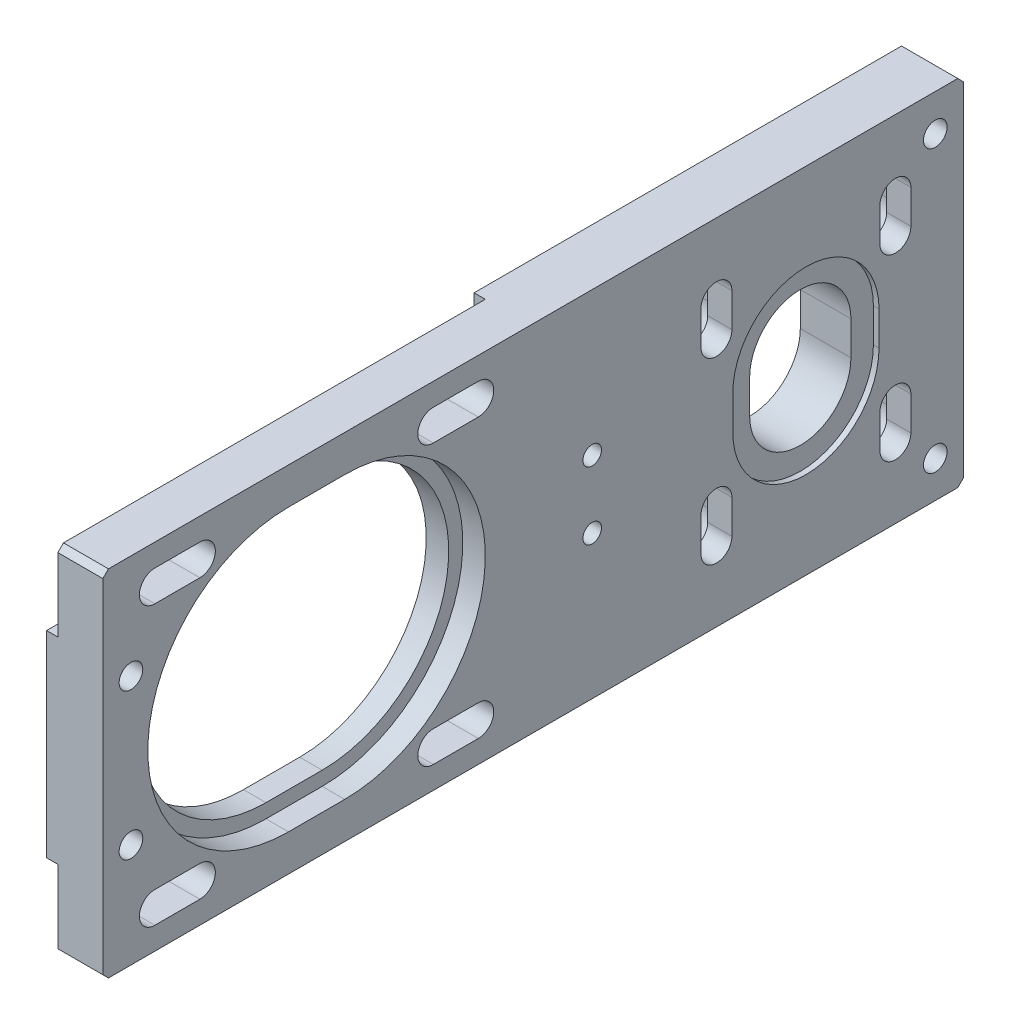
ISO-10303-21;
HEADER;
FILE_DESCRIPTION(('STEP AP214'),'2;1');
FILE_NAME('part.step','',(''),(''),'','','');
FILE_SCHEMA(('AUTOMOTIVE_DESIGN { 1 0 10303 214 1 1 1 1 }'));
ENDSEC;
DATA;
#1=APPLICATION_CONTEXT('core data for automotive mechanical design processes');
#2=APPLICATION_PROTOCOL_DEFINITION('international standard','automotive_design',2000,#1);
#3=PRODUCT_CONTEXT('',#1,'mechanical');
#4=PRODUCT('Part','Part','',(#3));
#5=PRODUCT_RELATED_PRODUCT_CATEGORY('part','',(#4));
#6=PRODUCT_DEFINITION_FORMATION('','',#4);
#7=PRODUCT_DEFINITION_CONTEXT('part definition',#1,'design');
#8=PRODUCT_DEFINITION('design','',#6,#7);
#9=PRODUCT_DEFINITION_SHAPE('','',#8);
#10=(LENGTH_UNIT() NAMED_UNIT(*) SI_UNIT(.MILLI.,.METRE.));
#11=(NAMED_UNIT(*) PLANE_ANGLE_UNIT() SI_UNIT($,.RADIAN.));
#12=(NAMED_UNIT(*) SI_UNIT($,.STERADIAN.) SOLID_ANGLE_UNIT());
#13=UNCERTAINTY_MEASURE_WITH_UNIT(LENGTH_MEASURE(1.E-05),#10,'distance_accuracy_value','');
#14=(GEOMETRIC_REPRESENTATION_CONTEXT(3) GLOBAL_UNCERTAINTY_ASSIGNED_CONTEXT((#13)) GLOBAL_UNIT_ASSIGNED_CONTEXT((#10,
#11,#12)) REPRESENTATION_CONTEXT('',''));
#15=CARTESIAN_POINT('',(0.,0.,0.));
#16=DIRECTION('',(0.,0.,1.));
#17=DIRECTION('',(1.,0.,0.));
#18=AXIS2_PLACEMENT_3D('',#15,#16,#17);
#19=CARTESIAN_POINT('',(0.,34.5,28.));
#20=DIRECTION('',(1.,0.,0.));
#21=DIRECTION('',(0.,0.,-1.));
#22=AXIS2_PLACEMENT_3D('',#19,#20,#21);
#23=CYLINDRICAL_SURFACE('',#22,9.00000000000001);
#24=CARTESIAN_POINT('',(9.,34.5,28.));
#25=DIRECTION('',(1.,0.,0.));
#26=DIRECTION('',(0.,0.,-1.));
#27=AXIS2_PLACEMENT_3D('',#24,#25,#26);
#28=CIRCLE('',#27,9.00000000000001);
#29=CARTESIAN_POINT('',(9.,34.5,37.));
#30=VERTEX_POINT('',#29);
#31=CARTESIAN_POINT('',(9.,34.5,19.));
#32=VERTEX_POINT('',#31);
#33=EDGE_CURVE('E58',#30,#32,#28,.F.);
#34=ORIENTED_EDGE('',*,*,#33,.F.);
#35=DIRECTION('',(-1.,0.,0.));
#36=VECTOR('',#35,1.);
#37=CARTESIAN_POINT('',(10.,34.5,37.));
#38=LINE('',#37,#36);
#39=CARTESIAN_POINT('',(0.,34.5,37.));
#40=VERTEX_POINT('',#39);
#41=EDGE_CURVE('E585',#30,#40,#38,.T.);
#42=ORIENTED_EDGE('',*,*,#41,.T.);
#43=CARTESIAN_POINT('',(0.,34.5,28.));
#44=DIRECTION('',(1.,0.,0.));
#45=DIRECTION('',(0.,0.,-1.));
#46=AXIS2_PLACEMENT_3D('',#43,#44,#45);
#47=CIRCLE('',#46,9.00000000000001);
#48=CARTESIAN_POINT('',(0.,34.5,19.));
#49=VERTEX_POINT('',#48);
#50=EDGE_CURVE('E1057',#49,#40,#47,.T.);
#51=ORIENTED_EDGE('',*,*,#50,.F.);
#52=DIRECTION('',(-1.,0.,0.));
#53=VECTOR('',#52,1.);
#54=CARTESIAN_POINT('',(10.,34.5,19.));
#55=LINE('',#54,#53);
#56=EDGE_CURVE('E584',#32,#49,#55,.T.);
#57=ORIENTED_EDGE('',*,*,#56,.F.);
#58=EDGE_LOOP('',(#34,#42,#51,#57));
#59=FACE_BOUND('',#58,.T.);
#60=ADVANCED_FACE('F36',(#59),#23,.F.);
#61=CARTESIAN_POINT('',(10.,34.5,37.));
#62=DIRECTION('',(0.,0.,1.));
#63=DIRECTION('',(1.,0.,0.));
#64=AXIS2_PLACEMENT_3D('',#61,#62,#63);
#65=PLANE('',#64);
#66=DIRECTION('',(0.,1.,0.));
#67=VECTOR('',#66,1.);
#68=CARTESIAN_POINT('',(9.,34.5,37.));
#69=LINE('',#68,#67);
#70=CARTESIAN_POINT('',(9.,28.5,37.));
#71=VERTEX_POINT('',#70);
#72=EDGE_CURVE('E572',#71,#30,#69,.T.);
#73=ORIENTED_EDGE('',*,*,#72,.F.);
#74=DIRECTION('',(-1.,0.,0.));
#75=VECTOR('',#74,1.);
#76=CARTESIAN_POINT('',(10.,28.5,37.));
#77=LINE('',#76,#75);
#78=CARTESIAN_POINT('',(0.,28.5,37.));
#79=VERTEX_POINT('',#78);
#80=EDGE_CURVE('E588',#71,#79,#77,.T.);
#81=ORIENTED_EDGE('',*,*,#80,.T.);
#82=DIRECTION('',(0.,1.,0.));
#83=VECTOR('',#82,1.);
#84=CARTESIAN_POINT('',(0.,34.5,37.));
#85=LINE('',#84,#83);
#86=EDGE_CURVE('E581',#79,#40,#85,.T.);
#87=ORIENTED_EDGE('',*,*,#86,.T.);
#88=ORIENTED_EDGE('',*,*,#41,.F.);
#89=EDGE_LOOP('',(#73,#81,#87,#88));
#90=FACE_BOUND('',#89,.T.);
#91=ADVANCED_FACE('F1287',(#90),#65,.F.);
#92=CARTESIAN_POINT('',(10.,28.5,28.));
#93=DIRECTION('',(-1.,0.,0.));
#94=DIRECTION('',(0.,0.,1.));
#95=AXIS2_PLACEMENT_3D('',#92,#93,#94);
#96=CYLINDRICAL_SURFACE('',#95,9.);
#97=CARTESIAN_POINT('',(9.,28.5,28.));
#98=DIRECTION('',(1.,0.,0.));
#99=DIRECTION('',(0.,0.,-1.));
#100=AXIS2_PLACEMENT_3D('',#97,#98,#99);
#101=CIRCLE('',#100,9.);
#102=CARTESIAN_POINT('',(9.,28.5,19.));
#103=VERTEX_POINT('',#102);
#104=EDGE_CURVE('E567',#103,#71,#101,.F.);
#105=ORIENTED_EDGE('',*,*,#104,.F.);
#106=DIRECTION('',(-1.,0.,0.));
#107=VECTOR('',#106,1.);
#108=CARTESIAN_POINT('',(10.,28.5,19.));
#109=LINE('',#108,#107);
#110=CARTESIAN_POINT('',(0.,28.5,19.));
#111=VERTEX_POINT('',#110);
#112=EDGE_CURVE('E590',#103,#111,#109,.T.);
#113=ORIENTED_EDGE('',*,*,#112,.T.);
#114=CARTESIAN_POINT('',(0.,28.5,28.));
#115=DIRECTION('',(-1.,0.,0.));
#116=DIRECTION('',(0.,0.,1.));
#117=AXIS2_PLACEMENT_3D('',#114,#115,#116);
#118=CIRCLE('',#117,9.);
#119=EDGE_CURVE('E578',#111,#79,#118,.T.);
#120=ORIENTED_EDGE('',*,*,#119,.T.);
#121=ORIENTED_EDGE('',*,*,#80,.F.);
#122=EDGE_LOOP('',(#105,#113,#120,#121));
#123=FACE_BOUND('',#122,.T.);
#124=ADVANCED_FACE('F1293',(#123),#96,.F.);
#125=CARTESIAN_POINT('',(10.,34.5,19.));
#126=DIRECTION('',(0.,0.,-1.));
#127=DIRECTION('',(-1.,0.,0.));
#128=AXIS2_PLACEMENT_3D('',#125,#126,#127);
#129=PLANE('',#128);
#130=DIRECTION('',(0.,-1.,0.));
#131=VECTOR('',#130,1.);
#132=CARTESIAN_POINT('',(9.,34.5,19.));
#133=LINE('',#132,#131);
#134=EDGE_CURVE('E11',#32,#103,#133,.T.);
#135=ORIENTED_EDGE('',*,*,#134,.F.);
#136=ORIENTED_EDGE('',*,*,#56,.T.);
#137=DIRECTION('',(0.,-1.,0.));
#138=VECTOR('',#137,1.);
#139=CARTESIAN_POINT('',(0.,34.5,19.));
#140=LINE('',#139,#138);
#141=EDGE_CURVE('E575',#49,#111,#140,.T.);
#142=ORIENTED_EDGE('',*,*,#141,.T.);
#143=ORIENTED_EDGE('',*,*,#112,.F.);
#144=EDGE_LOOP('',(#135,#136,#142,#143));
#145=FACE_BOUND('',#144,.T.);
#146=ADVANCED_FACE('F1385',(#145),#129,.F.);
#147=CARTESIAN_POINT('',(0.,50.4099025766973,43.9099025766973));
#148=DIRECTION('',(-1.,0.,0.));
#149=DIRECTION('',(0.,0.,1.));
#150=AXIS2_PLACEMENT_3D('',#147,#148,#149);
#151=CYLINDRICAL_SURFACE('',#150,2.75);
#152=DIRECTION('',(-1.,0.,0.));
#153=VECTOR('',#152,1.);
#154=CARTESIAN_POINT('',(10.,50.4099025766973,46.6599025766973));
#155=LINE('',#154,#153);
#156=CARTESIAN_POINT('',(10.,50.4099025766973,46.6599025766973));
#157=VERTEX_POINT('',#156);
#158=CARTESIAN_POINT('',(5.7,50.4099025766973,46.6599025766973));
#159=VERTEX_POINT('',#158);
#160=EDGE_CURVE('E608',#157,#159,#155,.T.);
#161=ORIENTED_EDGE('',*,*,#160,.T.);
#162=CARTESIAN_POINT('',(5.7,50.4099025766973,43.9099025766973));
#163=DIRECTION('',(-1.,0.,0.));
#164=DIRECTION('',(0.,0.,1.));
#165=AXIS2_PLACEMENT_3D('',#162,#163,#164);
#166=CIRCLE('',#165,2.75);
#167=CARTESIAN_POINT('',(5.7,50.4099025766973,41.1599025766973));
#168=VERTEX_POINT('',#167);
#169=EDGE_CURVE('E842',#159,#168,#166,.T.);
#170=ORIENTED_EDGE('',*,*,#169,.T.);
#171=DIRECTION('',(-1.,0.,0.));
#172=VECTOR('',#171,1.);
#173=CARTESIAN_POINT('',(10.,50.4099025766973,41.1599025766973));
#174=LINE('',#173,#172);
#175=CARTESIAN_POINT('',(10.,50.4099025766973,41.1599025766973));
#176=VERTEX_POINT('',#175);
#177=EDGE_CURVE('E631',#176,#168,#174,.T.);
#178=ORIENTED_EDGE('',*,*,#177,.F.);
#179=CARTESIAN_POINT('',(10.,50.4099025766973,43.9099025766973));
#180=DIRECTION('',(-1.,0.,0.));
#181=DIRECTION('',(0.,0.,1.));
#182=AXIS2_PLACEMENT_3D('',#179,#180,#181);
#183=CIRCLE('',#182,2.75);
#184=EDGE_CURVE('E845',#157,#176,#183,.T.);
#185=ORIENTED_EDGE('',*,*,#184,.F.);
#186=EDGE_LOOP('',(#161,#170,#178,#185));
#187=FACE_BOUND('',#186,.T.);
#188=ADVANCED_FACE('F1373',(#187),#151,.F.);
#189=CARTESIAN_POINT('',(0.,50.4099025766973,12.0900974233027));
#190=DIRECTION('',(-1.,0.,0.));
#191=DIRECTION('',(0.,0.,1.));
#192=AXIS2_PLACEMENT_3D('',#189,#190,#191);
#193=CYLINDRICAL_SURFACE('',#192,2.75);
#194=DIRECTION('',(-1.,0.,0.));
#195=VECTOR('',#194,1.);
#196=CARTESIAN_POINT('',(10.,50.4099025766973,14.8400974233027));
#197=LINE('',#196,#195);
#198=CARTESIAN_POINT('',(10.,50.4099025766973,14.8400974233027));
#199=VERTEX_POINT('',#198);
#200=CARTESIAN_POINT('',(5.7,50.4099025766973,14.8400974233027));
#201=VERTEX_POINT('',#200);
#202=EDGE_CURVE('E636',#199,#201,#197,.T.);
#203=ORIENTED_EDGE('',*,*,#202,.T.);
#204=CARTESIAN_POINT('',(5.7,50.4099025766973,12.0900974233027));
#205=DIRECTION('',(-1.,0.,0.));
#206=DIRECTION('',(0.,0.,1.));
#207=AXIS2_PLACEMENT_3D('',#204,#205,#206);
#208=CIRCLE('',#207,2.75);
#209=CARTESIAN_POINT('',(5.7,50.4099025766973,9.34009742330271));
#210=VERTEX_POINT('',#209);
#211=EDGE_CURVE('E830',#201,#210,#208,.T.);
#212=ORIENTED_EDGE('',*,*,#211,.T.);
#213=DIRECTION('',(-1.,0.,0.));
#214=VECTOR('',#213,1.);
#215=CARTESIAN_POINT('',(10.,50.4099025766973,9.34009742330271));
#216=LINE('',#215,#214);
#217=CARTESIAN_POINT('',(10.,50.4099025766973,9.34009742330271));
#218=VERTEX_POINT('',#217);
#219=EDGE_CURVE('E657',#218,#210,#216,.T.);
#220=ORIENTED_EDGE('',*,*,#219,.F.);
#221=CARTESIAN_POINT('',(10.,50.4099025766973,12.0900974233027));
#222=DIRECTION('',(-1.,0.,0.));
#223=DIRECTION('',(0.,0.,1.));
#224=AXIS2_PLACEMENT_3D('',#221,#222,#223);
#225=CIRCLE('',#224,2.75);
#226=EDGE_CURVE('E833',#199,#218,#225,.T.);
#227=ORIENTED_EDGE('',*,*,#226,.F.);
#228=EDGE_LOOP('',(#203,#212,#220,#227));
#229=FACE_BOUND('',#228,.T.);
#230=ADVANCED_FACE('F1361',(#229),#193,.F.);
#231=CARTESIAN_POINT('',(0.,18.5900974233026,12.0900974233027));
#232=DIRECTION('',(-1.,0.,0.));
#233=DIRECTION('',(0.,0.,1.));
#234=AXIS2_PLACEMENT_3D('',#231,#232,#233);
#235=CYLINDRICAL_SURFACE('',#234,2.75);
#236=DIRECTION('',(-1.,0.,0.));
#237=VECTOR('',#236,1.);
#238=CARTESIAN_POINT('',(10.,18.5900974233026,14.8400974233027));
#239=LINE('',#238,#237);
#240=CARTESIAN_POINT('',(10.,18.5900974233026,14.8400974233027));
#241=VERTEX_POINT('',#240);
#242=CARTESIAN_POINT('',(5.7,18.5900974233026,14.8400974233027));
#243=VERTEX_POINT('',#242);
#244=EDGE_CURVE('E612',#241,#243,#239,.T.);
#245=ORIENTED_EDGE('',*,*,#244,.T.);
#246=CARTESIAN_POINT('',(5.7,18.5900974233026,12.0900974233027));
#247=DIRECTION('',(-1.,0.,0.));
#248=DIRECTION('',(0.,0.,1.));
#249=AXIS2_PLACEMENT_3D('',#246,#247,#248);
#250=CIRCLE('',#249,2.75);
#251=CARTESIAN_POINT('',(5.7,18.5900974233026,9.34009742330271));
#252=VERTEX_POINT('',#251);
#253=EDGE_CURVE('E818',#243,#252,#250,.T.);
#254=ORIENTED_EDGE('',*,*,#253,.T.);
#255=DIRECTION('',(-1.,0.,0.));
#256=VECTOR('',#255,1.);
#257=CARTESIAN_POINT('',(10.,18.5900974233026,9.34009742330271));
#258=LINE('',#257,#256);
#259=CARTESIAN_POINT('',(10.,18.5900974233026,9.34009742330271));
#260=VERTEX_POINT('',#259);
#261=EDGE_CURVE('E603',#260,#252,#258,.T.);
#262=ORIENTED_EDGE('',*,*,#261,.F.);
#263=CARTESIAN_POINT('',(10.,18.5900974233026,12.0900974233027));
#264=DIRECTION('',(-1.,0.,0.));
#265=DIRECTION('',(0.,0.,1.));
#266=AXIS2_PLACEMENT_3D('',#263,#264,#265);
#267=CIRCLE('',#266,2.75);
#268=EDGE_CURVE('E821',#241,#260,#267,.T.);
#269=ORIENTED_EDGE('',*,*,#268,.F.);
#270=EDGE_LOOP('',(#245,#254,#262,#269));
#271=FACE_BOUND('',#270,.T.);
#272=ADVANCED_FACE('F1349',(#271),#235,.F.);
#273=CARTESIAN_POINT('',(0.,18.5900974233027,43.9099025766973));
#274=DIRECTION('',(-1.,0.,0.));
#275=DIRECTION('',(0.,0.,1.));
#276=AXIS2_PLACEMENT_3D('',#273,#274,#275);
#277=CYLINDRICAL_SURFACE('',#276,2.75);
#278=DIRECTION('',(-1.,0.,0.));
#279=VECTOR('',#278,1.);
#280=CARTESIAN_POINT('',(10.,18.5900974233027,46.6599025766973));
#281=LINE('',#280,#279);
#282=CARTESIAN_POINT('',(10.,18.5900974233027,46.6599025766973));
#283=VERTEX_POINT('',#282);
#284=CARTESIAN_POINT('',(5.7,18.5900974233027,46.6599025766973));
#285=VERTEX_POINT('',#284);
#286=EDGE_CURVE('E688',#283,#285,#281,.T.);
#287=ORIENTED_EDGE('',*,*,#286,.T.);
#288=CARTESIAN_POINT('',(5.7,18.5900974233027,43.9099025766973));
#289=DIRECTION('',(-1.,0.,0.));
#290=DIRECTION('',(0.,0.,1.));
#291=AXIS2_PLACEMENT_3D('',#288,#289,#290);
#292=CIRCLE('',#291,2.75);
#293=CARTESIAN_POINT('',(5.7,18.5900974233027,41.1599025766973));
#294=VERTEX_POINT('',#293);
#295=EDGE_CURVE('E806',#285,#294,#292,.T.);
#296=ORIENTED_EDGE('',*,*,#295,.T.);
#297=DIRECTION('',(-1.,0.,0.));
#298=VECTOR('',#297,1.);
#299=CARTESIAN_POINT('',(10.,18.5900974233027,41.1599025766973));
#300=LINE('',#299,#298);
#301=CARTESIAN_POINT('',(10.,18.5900974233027,41.1599025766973));
#302=VERTEX_POINT('',#301);
#303=EDGE_CURVE('E681',#302,#294,#300,.T.);
#304=ORIENTED_EDGE('',*,*,#303,.F.);
#305=CARTESIAN_POINT('',(10.,18.5900974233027,43.9099025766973));
#306=DIRECTION('',(-1.,0.,0.));
#307=DIRECTION('',(0.,0.,1.));
#308=AXIS2_PLACEMENT_3D('',#305,#306,#307);
#309=CIRCLE('',#308,2.75);
#310=EDGE_CURVE('E809',#283,#302,#309,.T.);
#311=ORIENTED_EDGE('',*,*,#310,.F.);
#312=EDGE_LOOP('',(#287,#296,#304,#311));
#313=FACE_BOUND('',#312,.T.);
#314=ADVANCED_FACE('F1346',(#313),#277,.F.);
#315=CARTESIAN_POINT('',(0.,0.,0.));
#316=DIRECTION('',(1.,0.,0.));
#317=DIRECTION('',(0.,0.,-1.));
#318=AXIS2_PLACEMENT_3D('',#315,#316,#317);
#319=PLANE('',#318);
#320=CARTESIAN_POINT('',(0.,12.5900974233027,43.9099025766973));
#321=DIRECTION('',(-1.,0.,0.));
#322=DIRECTION('',(0.,0.,1.));
#323=AXIS2_PLACEMENT_3D('',#320,#321,#322);
#324=CIRCLE('',#323,5.);
#325=CARTESIAN_POINT('',(0.,12.5900974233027,38.9099025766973));
#326=VERTEX_POINT('',#325);
#327=CARTESIAN_POINT('',(0.,12.5900974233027,48.9099025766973));
#328=VERTEX_POINT('',#327);
#329=EDGE_CURVE('E778',#326,#328,#324,.T.);
#330=ORIENTED_EDGE('',*,*,#329,.F.);
#331=DIRECTION('',(0.,-1.,0.));
#332=VECTOR('',#331,1.);
#333=CARTESIAN_POINT('',(0.,18.5900974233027,38.9099025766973));
#334=LINE('',#333,#332);
#335=CARTESIAN_POINT('',(0.,18.5900974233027,38.9099025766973));
#336=VERTEX_POINT('',#335);
#337=EDGE_CURVE('E724',#336,#326,#334,.T.);
#338=ORIENTED_EDGE('',*,*,#337,.F.);
#339=CARTESIAN_POINT('',(0.,18.5900974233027,43.9099025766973));
#340=DIRECTION('',(-1.,0.,0.));
#341=DIRECTION('',(0.,0.,1.));
#342=AXIS2_PLACEMENT_3D('',#339,#340,#341);
#343=CIRCLE('',#342,5.);
#344=CARTESIAN_POINT('',(0.,18.5900974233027,48.9099025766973));
#345=VERTEX_POINT('',#344);
#346=EDGE_CURVE('E800',#345,#336,#343,.T.);
#347=ORIENTED_EDGE('',*,*,#346,.F.);
#348=DIRECTION('',(0.,1.,0.));
#349=VECTOR('',#348,1.);
#350=CARTESIAN_POINT('',(0.,18.5900974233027,48.9099025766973));
#351=LINE('',#350,#349);
#352=EDGE_CURVE('E775',#328,#345,#351,.T.);
#353=ORIENTED_EDGE('',*,*,#352,.F.);
#354=EDGE_LOOP('',(#330,#338,#347,#353));
#355=FACE_BOUND('',#354,.T.);
#356=CARTESIAN_POINT('',(0.,12.5900974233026,12.0900974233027));
#357=DIRECTION('',(-1.,0.,0.));
#358=DIRECTION('',(0.,0.,1.));
#359=AXIS2_PLACEMENT_3D('',#356,#357,#358);
#360=CIRCLE('',#359,5.);
#361=CARTESIAN_POINT('',(0.,12.5900974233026,7.09009742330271));
#362=VERTEX_POINT('',#361);
#363=CARTESIAN_POINT('',(0.,12.5900974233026,17.0900974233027));
#364=VERTEX_POINT('',#363);
#365=EDGE_CURVE('E700',#362,#364,#360,.T.);
#366=ORIENTED_EDGE('',*,*,#365,.F.);
#367=DIRECTION('',(0.,-1.,0.));
#368=VECTOR('',#367,1.);
#369=CARTESIAN_POINT('',(0.,18.5900974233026,7.09009742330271));
#370=LINE('',#369,#368);
#371=CARTESIAN_POINT('',(0.,18.5900974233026,7.09009742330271));
#372=VERTEX_POINT('',#371);
#373=EDGE_CURVE('E703',#372,#362,#370,.T.);
#374=ORIENTED_EDGE('',*,*,#373,.F.);
#375=CARTESIAN_POINT('',(0.,18.5900974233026,12.0900974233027));
#376=DIRECTION('',(-1.,0.,0.));
#377=DIRECTION('',(0.,0.,1.));
#378=AXIS2_PLACEMENT_3D('',#375,#376,#377);
#379=CIRCLE('',#378,5.);
#380=CARTESIAN_POINT('',(0.,18.5900974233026,17.0900974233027));
#381=VERTEX_POINT('',#380);
#382=EDGE_CURVE('E812',#381,#372,#379,.T.);
#383=ORIENTED_EDGE('',*,*,#382,.F.);
#384=DIRECTION('',(0.,1.,0.));
#385=VECTOR('',#384,1.);
#386=CARTESIAN_POINT('',(0.,18.5900974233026,17.0900974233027));
#387=LINE('',#386,#385);
#388=EDGE_CURVE('E697',#364,#381,#387,.T.);
#389=ORIENTED_EDGE('',*,*,#388,.F.);
#390=EDGE_LOOP('',(#366,#374,#383,#389));
#391=FACE_BOUND('',#390,.T.);
#392=CARTESIAN_POINT('',(0.,44.4099025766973,12.0900974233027));
#393=DIRECTION('',(-1.,0.,0.));
#394=DIRECTION('',(0.,0.,1.));
#395=AXIS2_PLACEMENT_3D('',#392,#393,#394);
#396=CIRCLE('',#395,5.);
#397=CARTESIAN_POINT('',(0.,44.4099025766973,7.09009742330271));
#398=VERTEX_POINT('',#397);
#399=CARTESIAN_POINT('',(0.,44.4099025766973,17.0900974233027));
#400=VERTEX_POINT('',#399);
#401=EDGE_CURVE('E754',#398,#400,#396,.T.);
#402=ORIENTED_EDGE('',*,*,#401,.F.);
#403=DIRECTION('',(0.,-1.,0.));
#404=VECTOR('',#403,1.);
#405=CARTESIAN_POINT('',(0.,50.4099025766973,7.09009742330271));
#406=LINE('',#405,#404);
#407=CARTESIAN_POINT('',(0.,50.4099025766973,7.09009742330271));
#408=VERTEX_POINT('',#407);
#409=EDGE_CURVE('E691',#408,#398,#406,.T.);
#410=ORIENTED_EDGE('',*,*,#409,.F.);
#411=CARTESIAN_POINT('',(0.,50.4099025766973,12.0900974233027));
#412=DIRECTION('',(-1.,0.,0.));
#413=DIRECTION('',(0.,0.,1.));
#414=AXIS2_PLACEMENT_3D('',#411,#412,#413);
#415=CIRCLE('',#414,5.);
#416=CARTESIAN_POINT('',(0.,50.4099025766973,17.0900974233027));
#417=VERTEX_POINT('',#416);
#418=EDGE_CURVE('E824',#417,#408,#415,.T.);
#419=ORIENTED_EDGE('',*,*,#418,.F.);
#420=DIRECTION('',(0.,1.,0.));
#421=VECTOR('',#420,1.);
#422=CARTESIAN_POINT('',(0.,50.4099025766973,17.0900974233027));
#423=LINE('',#422,#421);
#424=EDGE_CURVE('E751',#400,#417,#423,.T.);
#425=ORIENTED_EDGE('',*,*,#424,.F.);
#426=EDGE_LOOP('',(#402,#410,#419,#425));
#427=FACE_BOUND('',#426,.T.);
#428=CARTESIAN_POINT('',(0.,44.4099025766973,43.9099025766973));
#429=DIRECTION('',(-1.,0.,0.));
#430=DIRECTION('',(0.,0.,1.));
#431=AXIS2_PLACEMENT_3D('',#428,#429,#430);
#432=CIRCLE('',#431,5.);
#433=CARTESIAN_POINT('',(0.,44.4099025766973,38.9099025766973));
#434=VERTEX_POINT('',#433);
#435=CARTESIAN_POINT('',(0.,44.4099025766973,48.9099025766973));
#436=VERTEX_POINT('',#435);
#437=EDGE_CURVE('E728',#434,#436,#432,.T.);
#438=ORIENTED_EDGE('',*,*,#437,.F.);
#439=DIRECTION('',(0.,-1.,0.));
#440=VECTOR('',#439,1.);
#441=CARTESIAN_POINT('',(0.,50.4099025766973,38.9099025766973));
#442=LINE('',#441,#440);
#443=CARTESIAN_POINT('',(0.,50.4099025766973,38.9099025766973));
#444=VERTEX_POINT('',#443);
#445=EDGE_CURVE('E731',#444,#434,#442,.T.);
#446=ORIENTED_EDGE('',*,*,#445,.F.);
#447=CARTESIAN_POINT('',(0.,50.4099025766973,43.9099025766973));
#448=DIRECTION('',(-1.,0.,0.));
#449=DIRECTION('',(0.,0.,1.));
#450=AXIS2_PLACEMENT_3D('',#447,#448,#449);
#451=CIRCLE('',#450,5.);
#452=CARTESIAN_POINT('',(0.,50.4099025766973,48.9099025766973));
#453=VERTEX_POINT('',#452);
#454=EDGE_CURVE('E836',#453,#444,#451,.T.);
#455=ORIENTED_EDGE('',*,*,#454,.F.);
#456=DIRECTION('',(0.,1.,0.));
#457=VECTOR('',#456,1.);
#458=CARTESIAN_POINT('',(0.,50.4099025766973,48.9099025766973));
#459=LINE('',#458,#457);
#460=EDGE_CURVE('E725',#436,#453,#459,.T.);
#461=ORIENTED_EDGE('',*,*,#460,.F.);
#462=EDGE_LOOP('',(#438,#446,#455,#461));
#463=FACE_BOUND('',#462,.T.);
#464=CARTESIAN_POINT('',(0.,6.49999999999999,5.));
#465=DIRECTION('',(-1.,0.,0.));
#466=DIRECTION('',(0.,0.,1.));
#467=AXIS2_PLACEMENT_3D('',#464,#465,#466);
#468=CIRCLE('',#467,2.09999999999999);
#469=CARTESIAN_POINT('',(0.,6.49999999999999,7.09999999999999));
#470=VERTEX_POINT('',#469);
#471=EDGE_CURVE('E860',#470,#470,#468,.T.);
#472=ORIENTED_EDGE('',*,*,#471,.F.);
#473=EDGE_LOOP('',(#472));
#474=FACE_BOUND('',#473,.T.);
#475=CARTESIAN_POINT('',(0.,56.4999999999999,5.));
#476=DIRECTION('',(-1.,0.,0.));
#477=DIRECTION('',(0.,0.,1.));
#478=AXIS2_PLACEMENT_3D('',#475,#476,#477);
#479=CIRCLE('',#478,2.09999999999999);
#480=CARTESIAN_POINT('',(0.,56.4999999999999,7.09999999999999));
#481=VERTEX_POINT('',#480);
#482=EDGE_CURVE('E864',#481,#481,#479,.T.);
#483=ORIENTED_EDGE('',*,*,#482,.F.);
#484=EDGE_LOOP('',(#483));
#485=FACE_BOUND('',#484,.T.);
#486=CARTESIAN_POINT('',(0.,37.5,66.));
#487=DIRECTION('',(-1.,0.,0.));
#488=DIRECTION('',(0.,0.,1.));
#489=AXIS2_PLACEMENT_3D('',#486,#487,#488);
#490=CIRCLE('',#489,1.65);
#491=CARTESIAN_POINT('',(0.,37.5,67.65));
#492=VERTEX_POINT('',#491);
#493=EDGE_CURVE('E868',#492,#492,#490,.T.);
#494=ORIENTED_EDGE('',*,*,#493,.F.);
#495=EDGE_LOOP('',(#494));
#496=FACE_BOUND('',#495,.T.);
#497=CARTESIAN_POINT('',(0.,25.5,66.));
#498=DIRECTION('',(-1.,0.,0.));
#499=DIRECTION('',(0.,0.,1.));
#500=AXIS2_PLACEMENT_3D('',#497,#498,#499);
#501=CIRCLE('',#500,1.65);
#502=CARTESIAN_POINT('',(0.,25.5,67.65));
#503=VERTEX_POINT('',#502);
#504=EDGE_CURVE('E874',#503,#503,#501,.T.);
#505=ORIENTED_EDGE('',*,*,#504,.F.);
#506=EDGE_LOOP('',(#505));
#507=FACE_BOUND('',#506,.T.);
#508=ORIENTED_EDGE('',*,*,#50,.T.);
#509=ORIENTED_EDGE('',*,*,#86,.F.);
#510=ORIENTED_EDGE('',*,*,#119,.F.);
#511=ORIENTED_EDGE('',*,*,#141,.F.);
#512=EDGE_LOOP('',(#508,#509,#510,#511));
#513=FACE_BOUND('',#512,.T.);
#514=DIRECTION('',(0.,1.,0.));
#515=VECTOR('',#514,1.);
#516=CARTESIAN_POINT('',(0.,0.,0.));
#517=LINE('',#516,#515);
#518=CARTESIAN_POINT('',(0.,1.,0.));
#519=VERTEX_POINT('',#518);
#520=CARTESIAN_POINT('',(0.,62.,0.));
#521=VERTEX_POINT('',#520);
#522=EDGE_CURVE('E1060',#519,#521,#517,.T.);
#523=ORIENTED_EDGE('',*,*,#522,.F.);
#524=DIRECTION('',(0.,0.707106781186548,-0.707106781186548));
#525=VECTOR('',#524,1.);
#526=CARTESIAN_POINT('',(0.,1.,0.));
#527=LINE('',#526,#525);
#528=CARTESIAN_POINT('',(0.,0.,1.));
#529=VERTEX_POINT('',#528);
#530=EDGE_CURVE('E1132',#519,#529,#527,.F.);
#531=ORIENTED_EDGE('',*,*,#530,.T.);
#532=DIRECTION('',(0.,0.,-1.));
#533=VECTOR('',#532,1.);
#534=CARTESIAN_POINT('',(0.,0.,0.));
#535=LINE('',#534,#533);
#536=CARTESIAN_POINT('',(0.,0.,77.));
#537=VERTEX_POINT('',#536);
#538=EDGE_CURVE('E1065',#537,#529,#535,.T.);
#539=ORIENTED_EDGE('',*,*,#538,.F.);
#540=DIRECTION('',(0.,-1.,0.));
#541=VECTOR('',#540,1.);
#542=CARTESIAN_POINT('',(0.,-1.50000000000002,77.));
#543=LINE('',#542,#541);
#544=CARTESIAN_POINT('',(0.,63.,77.));
#545=VERTEX_POINT('',#544);
#546=EDGE_CURVE('E964',#545,#537,#543,.T.);
#547=ORIENTED_EDGE('',*,*,#546,.F.);
#548=DIRECTION('',(0.,0.,1.));
#549=VECTOR('',#548,1.);
#550=CARTESIAN_POINT('',(0.,63.,0.));
#551=LINE('',#550,#549);
#552=CARTESIAN_POINT('',(0.,63.,1.));
#553=VERTEX_POINT('',#552);
#554=EDGE_CURVE('E1077',#553,#545,#551,.T.);
#555=ORIENTED_EDGE('',*,*,#554,.F.);
#556=DIRECTION('',(0.,0.707106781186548,0.707106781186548));
#557=VECTOR('',#556,1.);
#558=CARTESIAN_POINT('',(0.,63.,1.));
#559=LINE('',#558,#557);
#560=EDGE_CURVE('E1130',#553,#521,#559,.F.);
#561=ORIENTED_EDGE('',*,*,#560,.T.);
#562=EDGE_LOOP('',(#523,#531,#539,#547,#555,#561));
#563=FACE_BOUND('',#562,.T.);
#564=ADVANCED_FACE('F1253',(#355,#391,#427,#463,#474,#485,#496,#507,#513,#563),#319,.F.);
#565=CARTESIAN_POINT('',(0.,31.5,110.));
#566=DIRECTION('',(1.,0.,0.));
#567=DIRECTION('',(0.,0.,-1.));
#568=AXIS2_PLACEMENT_3D('',#565,#566,#567);
#569=CYLINDRICAL_SURFACE('',#568,22.5);
#570=CARTESIAN_POINT('',(2.,31.5,110.));
#571=DIRECTION('',(-1.,0.,0.));
#572=DIRECTION('',(0.,0.,1.));
#573=AXIS2_PLACEMENT_3D('',#570,#571,#572);
#574=CIRCLE('',#573,22.5);
#575=CARTESIAN_POINT('',(2.,8.99999999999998,110.));
#576=VERTEX_POINT('',#575);
#577=CARTESIAN_POINT('',(2.,54.,110.));
#578=VERTEX_POINT('',#577);
#579=EDGE_CURVE('E987',#576,#578,#574,.F.);
#580=ORIENTED_EDGE('',*,*,#579,.F.);
#581=DIRECTION('',(1.,0.,0.));
#582=VECTOR('',#581,1.);
#583=CARTESIAN_POINT('',(0.,8.99999999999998,110.));
#584=LINE('',#583,#582);
#585=CARTESIAN_POINT('',(6.,8.99999999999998,110.));
#586=VERTEX_POINT('',#585);
#587=EDGE_CURVE('E1019',#576,#586,#584,.T.);
#588=ORIENTED_EDGE('',*,*,#587,.T.);
#589=CARTESIAN_POINT('',(6.,31.5,110.));
#590=DIRECTION('',(1.,0.,0.));
#591=DIRECTION('',(0.,0.,-1.));
#592=AXIS2_PLACEMENT_3D('',#589,#590,#591);
#593=CIRCLE('',#592,22.5);
#594=CARTESIAN_POINT('',(6.,54.,110.));
#595=VERTEX_POINT('',#594);
#596=EDGE_CURVE('E1003',#586,#595,#593,.T.);
#597=ORIENTED_EDGE('',*,*,#596,.T.);
#598=DIRECTION('',(1.,0.,0.));
#599=VECTOR('',#598,1.);
#600=CARTESIAN_POINT('',(0.,54.,110.));
#601=LINE('',#600,#599);
#602=EDGE_CURVE('E1007',#578,#595,#601,.T.);
#603=ORIENTED_EDGE('',*,*,#602,.F.);
#604=EDGE_LOOP('',(#580,#588,#597,#603));
#605=FACE_BOUND('',#604,.T.);
#606=ADVANCED_FACE('F1271',(#605),#569,.F.);
#607=CARTESIAN_POINT('',(0.,8.99999999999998,110.));
#608=DIRECTION('',(0.,-1.,0.));
#609=DIRECTION('',(0.,0.,-1.));
#610=AXIS2_PLACEMENT_3D('',#607,#608,#609);
#611=PLANE('',#610);
#612=DIRECTION('',(0.,0.,-1.));
#613=VECTOR('',#612,1.);
#614=CARTESIAN_POINT('',(2.,8.99999999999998,110.));
#615=LINE('',#614,#613);
#616=CARTESIAN_POINT('',(2.,8.99999999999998,120.));
#617=VERTEX_POINT('',#616);
#618=EDGE_CURVE('E990',#617,#576,#615,.T.);
#619=ORIENTED_EDGE('',*,*,#618,.F.);
#620=DIRECTION('',(1.,0.,0.));
#621=VECTOR('',#620,1.);
#622=CARTESIAN_POINT('',(0.,8.99999999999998,120.));
#623=LINE('',#622,#621);
#624=CARTESIAN_POINT('',(6.,8.99999999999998,120.));
#625=VERTEX_POINT('',#624);
#626=EDGE_CURVE('E1022',#617,#625,#623,.T.);
#627=ORIENTED_EDGE('',*,*,#626,.T.);
#628=DIRECTION('',(0.,0.,-1.));
#629=VECTOR('',#628,1.);
#630=CARTESIAN_POINT('',(6.,8.99999999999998,110.));
#631=LINE('',#630,#629);
#632=EDGE_CURVE('E1008',#625,#586,#631,.T.);
#633=ORIENTED_EDGE('',*,*,#632,.T.);
#634=ORIENTED_EDGE('',*,*,#587,.F.);
#635=EDGE_LOOP('',(#619,#627,#633,#634));
#636=FACE_BOUND('',#635,.T.);
#637=ADVANCED_FACE('F1260',(#636),#611,.F.);
#638=CARTESIAN_POINT('',(0.,54.,110.));
#639=DIRECTION('',(0.,1.,0.));
#640=DIRECTION('',(0.,0.,1.));
#641=AXIS2_PLACEMENT_3D('',#638,#639,#640);
#642=PLANE('',#641);
#643=DIRECTION('',(0.,0.,1.));
#644=VECTOR('',#643,1.);
#645=CARTESIAN_POINT('',(2.,54.,110.));
#646=LINE('',#645,#644);
#647=CARTESIAN_POINT('',(2.,54.,120.));
#648=VERTEX_POINT('',#647);
#649=EDGE_CURVE('E1074',#578,#648,#646,.T.);
#650=ORIENTED_EDGE('',*,*,#649,.F.);
#651=ORIENTED_EDGE('',*,*,#602,.T.);
#652=DIRECTION('',(0.,0.,1.));
#653=VECTOR('',#652,1.);
#654=CARTESIAN_POINT('',(6.,54.,110.));
#655=LINE('',#654,#653);
#656=CARTESIAN_POINT('',(6.,54.,120.));
#657=VERTEX_POINT('',#656);
#658=EDGE_CURVE('E1011',#595,#657,#655,.T.);
#659=ORIENTED_EDGE('',*,*,#658,.T.);
#660=DIRECTION('',(1.,0.,0.));
#661=VECTOR('',#660,1.);
#662=CARTESIAN_POINT('',(0.,54.,120.));
#663=LINE('',#662,#661);
#664=EDGE_CURVE('E1024',#648,#657,#663,.T.);
#665=ORIENTED_EDGE('',*,*,#664,.F.);
#666=EDGE_LOOP('',(#650,#651,#659,#665));
#667=FACE_BOUND('',#666,.T.);
#668=ADVANCED_FACE('F1274',(#667),#642,.F.);
#669=CARTESIAN_POINT('',(10.,0.,0.));
#670=DIRECTION('',(1.,0.,0.));
#671=DIRECTION('',(0.,0.,-1.));
#672=AXIS2_PLACEMENT_3D('',#669,#670,#671);
#673=PLANE('',#672);
#674=CARTESIAN_POINT('',(10.,34.5,28.));
#675=DIRECTION('',(1.,0.,0.));
#676=DIRECTION('',(0.,0.,-1.));
#677=AXIS2_PLACEMENT_3D('',#674,#675,#676);
#678=CIRCLE('',#677,13.);
#679=CARTESIAN_POINT('',(10.,34.5,15.));
#680=VERTEX_POINT('',#679);
#681=CARTESIAN_POINT('',(10.,34.5,41.));
#682=VERTEX_POINT('',#681);
#683=EDGE_CURVE('E51',#680,#682,#678,.T.);
#684=ORIENTED_EDGE('',*,*,#683,.F.);
#685=DIRECTION('',(0.,1.,0.));
#686=VECTOR('',#685,1.);
#687=CARTESIAN_POINT('',(10.,34.5,15.));
#688=LINE('',#687,#686);
#689=CARTESIAN_POINT('',(10.,28.5,15.));
#690=VERTEX_POINT('',#689);
#691=EDGE_CURVE('E552',#690,#680,#688,.T.);
#692=ORIENTED_EDGE('',*,*,#691,.F.);
#693=CARTESIAN_POINT('',(10.,28.5,28.));
#694=DIRECTION('',(1.,0.,0.));
#695=DIRECTION('',(0.,0.,-1.));
#696=AXIS2_PLACEMENT_3D('',#693,#694,#695);
#697=CIRCLE('',#696,13.);
#698=CARTESIAN_POINT('',(10.,28.5,41.));
#699=VERTEX_POINT('',#698);
#700=EDGE_CURVE('E555',#699,#690,#697,.T.);
#701=ORIENTED_EDGE('',*,*,#700,.F.);
#702=DIRECTION('',(0.,-1.,0.));
#703=VECTOR('',#702,1.);
#704=CARTESIAN_POINT('',(10.,34.5,41.));
#705=LINE('',#704,#703);
#706=EDGE_CURVE('E561',#682,#699,#705,.T.);
#707=ORIENTED_EDGE('',*,*,#706,.F.);
#708=EDGE_LOOP('',(#684,#692,#701,#707));
#709=FACE_BOUND('',#708,.T.);
#710=DIRECTION('',(0.,1.,0.));
#711=VECTOR('',#710,1.);
#712=CARTESIAN_POINT('',(10.,18.5900974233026,14.8400974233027));
#713=LINE('',#712,#711);
#714=CARTESIAN_POINT('',(10.,12.5900974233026,14.8400974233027));
#715=VERTEX_POINT('',#714);
#716=EDGE_CURVE('E600',#715,#241,#713,.T.);
#717=ORIENTED_EDGE('',*,*,#716,.T.);
#718=ORIENTED_EDGE('',*,*,#268,.T.);
#719=DIRECTION('',(0.,-1.,0.));
#720=VECTOR('',#719,1.);
#721=CARTESIAN_POINT('',(10.,18.5900974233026,9.34009742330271));
#722=LINE('',#721,#720);
#723=CARTESIAN_POINT('',(10.,12.5900974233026,9.34009742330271));
#724=VERTEX_POINT('',#723);
#725=EDGE_CURVE('E593',#260,#724,#722,.T.);
#726=ORIENTED_EDGE('',*,*,#725,.T.);
#727=CARTESIAN_POINT('',(10.,12.5900974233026,12.0900974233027));
#728=DIRECTION('',(-1.,0.,0.));
#729=DIRECTION('',(0.,0.,1.));
#730=AXIS2_PLACEMENT_3D('',#727,#728,#729);
#731=CIRCLE('',#730,2.75);
#732=EDGE_CURVE('E596',#724,#715,#731,.T.);
#733=ORIENTED_EDGE('',*,*,#732,.T.);
#734=EDGE_LOOP('',(#717,#718,#726,#733));
#735=FACE_BOUND('',#734,.T.);
#736=DIRECTION('',(0.,1.,0.));
#737=VECTOR('',#736,1.);
#738=CARTESIAN_POINT('',(10.,50.4099025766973,46.6599025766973));
#739=LINE('',#738,#737);
#740=CARTESIAN_POINT('',(10.,44.4099025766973,46.6599025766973));
#741=VERTEX_POINT('',#740);
#742=EDGE_CURVE('E628',#741,#157,#739,.T.);
#743=ORIENTED_EDGE('',*,*,#742,.T.);
#744=ORIENTED_EDGE('',*,*,#184,.T.);
#745=DIRECTION('',(0.,-1.,0.));
#746=VECTOR('',#745,1.);
#747=CARTESIAN_POINT('',(10.,50.4099025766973,41.1599025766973));
#748=LINE('',#747,#746);
#749=CARTESIAN_POINT('',(10.,44.4099025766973,41.1599025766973));
#750=VERTEX_POINT('',#749);
#751=EDGE_CURVE('E621',#176,#750,#748,.T.);
#752=ORIENTED_EDGE('',*,*,#751,.T.);
#753=CARTESIAN_POINT('',(10.,44.4099025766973,43.9099025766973));
#754=DIRECTION('',(-1.,0.,0.));
#755=DIRECTION('',(0.,0.,1.));
#756=AXIS2_PLACEMENT_3D('',#753,#754,#755);
#757=CIRCLE('',#756,2.75);
#758=EDGE_CURVE('E624',#750,#741,#757,.T.);
#759=ORIENTED_EDGE('',*,*,#758,.T.);
#760=EDGE_LOOP('',(#743,#744,#752,#759));
#761=FACE_BOUND('',#760,.T.);
#762=DIRECTION('',(0.,1.,0.));
#763=VECTOR('',#762,1.);
#764=CARTESIAN_POINT('',(10.,50.4099025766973,14.8400974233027));
#765=LINE('',#764,#763);
#766=CARTESIAN_POINT('',(10.,44.4099025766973,14.8400974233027));
#767=VERTEX_POINT('',#766);
#768=EDGE_CURVE('E654',#767,#199,#765,.T.);
#769=ORIENTED_EDGE('',*,*,#768,.T.);
#770=ORIENTED_EDGE('',*,*,#226,.T.);
#771=DIRECTION('',(0.,-1.,0.));
#772=VECTOR('',#771,1.);
#773=CARTESIAN_POINT('',(10.,50.4099025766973,9.34009742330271));
#774=LINE('',#773,#772);
#775=CARTESIAN_POINT('',(10.,44.4099025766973,9.34009742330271));
#776=VERTEX_POINT('',#775);
#777=EDGE_CURVE('E647',#218,#776,#774,.T.);
#778=ORIENTED_EDGE('',*,*,#777,.T.);
#779=CARTESIAN_POINT('',(10.,44.4099025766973,12.0900974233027));
#780=DIRECTION('',(-1.,0.,0.));
#781=DIRECTION('',(0.,0.,1.));
#782=AXIS2_PLACEMENT_3D('',#779,#780,#781);
#783=CIRCLE('',#782,2.75);
#784=EDGE_CURVE('E650',#776,#767,#783,.T.);
#785=ORIENTED_EDGE('',*,*,#784,.T.);
#786=EDGE_LOOP('',(#769,#770,#778,#785));
#787=FACE_BOUND('',#786,.T.);
#788=DIRECTION('',(0.,1.,0.));
#789=VECTOR('',#788,1.);
#790=CARTESIAN_POINT('',(10.,18.5900974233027,46.6599025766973));
#791=LINE('',#790,#789);
#792=CARTESIAN_POINT('',(10.,12.5900974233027,46.6599025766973));
#793=VERTEX_POINT('',#792);
#794=EDGE_CURVE('E678',#793,#283,#791,.T.);
#795=ORIENTED_EDGE('',*,*,#794,.T.);
#796=ORIENTED_EDGE('',*,*,#310,.T.);
#797=DIRECTION('',(0.,-1.,0.));
#798=VECTOR('',#797,1.);
#799=CARTESIAN_POINT('',(10.,18.5900974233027,41.1599025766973));
#800=LINE('',#799,#798);
#801=CARTESIAN_POINT('',(10.,12.5900974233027,41.1599025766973));
#802=VERTEX_POINT('',#801);
#803=EDGE_CURVE('E671',#302,#802,#800,.T.);
#804=ORIENTED_EDGE('',*,*,#803,.T.);
#805=CARTESIAN_POINT('',(10.,12.5900974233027,43.9099025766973));
#806=DIRECTION('',(-1.,0.,0.));
#807=DIRECTION('',(0.,0.,1.));
#808=AXIS2_PLACEMENT_3D('',#805,#806,#807);
#809=CIRCLE('',#808,2.75);
#810=EDGE_CURVE('E674',#802,#793,#809,.T.);
#811=ORIENTED_EDGE('',*,*,#810,.T.);
#812=EDGE_LOOP('',(#795,#796,#804,#811));
#813=FACE_BOUND('',#812,.T.);
#814=CARTESIAN_POINT('',(10.,18.5,148.));
#815=DIRECTION('',(1.,0.,0.));
#816=DIRECTION('',(0.,0.,-1.));
#817=AXIS2_PLACEMENT_3D('',#814,#815,#816);
#818=CIRCLE('',#817,2.09999999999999);
#819=CARTESIAN_POINT('',(10.,18.5,145.9));
#820=VERTEX_POINT('',#819);
#821=EDGE_CURVE('E851',#820,#820,#818,.T.);
#822=ORIENTED_EDGE('',*,*,#821,.F.);
#823=EDGE_LOOP('',(#822));
#824=FACE_BOUND('',#823,.T.);
#825=CARTESIAN_POINT('',(10.,44.5,148.));
#826=DIRECTION('',(1.,0.,0.));
#827=DIRECTION('',(0.,0.,-1.));
#828=AXIS2_PLACEMENT_3D('',#825,#826,#827);
#829=CIRCLE('',#828,2.09999999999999);
#830=CARTESIAN_POINT('',(10.,44.5,145.9));
#831=VERTEX_POINT('',#830);
#832=EDGE_CURVE('E857',#831,#831,#829,.T.);
#833=ORIENTED_EDGE('',*,*,#832,.F.);
#834=EDGE_LOOP('',(#833));
#835=FACE_BOUND('',#834,.T.);
#836=CARTESIAN_POINT('',(10.,6.49999999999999,5.));
#837=DIRECTION('',(1.,0.,0.));
#838=DIRECTION('',(0.,0.,-1.));
#839=AXIS2_PLACEMENT_3D('',#836,#837,#838);
#840=CIRCLE('',#839,2.09999999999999);
#841=CARTESIAN_POINT('',(10.,6.49999999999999,2.90000000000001));
#842=VERTEX_POINT('',#841);
#843=EDGE_CURVE('E863',#842,#842,#840,.T.);
#844=ORIENTED_EDGE('',*,*,#843,.F.);
#845=EDGE_LOOP('',(#844));
#846=FACE_BOUND('',#845,.T.);
#847=CARTESIAN_POINT('',(10.,56.4999999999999,5.));
#848=DIRECTION('',(1.,0.,0.));
#849=DIRECTION('',(0.,0.,-1.));
#850=AXIS2_PLACEMENT_3D('',#847,#848,#849);
#851=CIRCLE('',#850,2.09999999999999);
#852=CARTESIAN_POINT('',(10.,56.4999999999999,2.9));
#853=VERTEX_POINT('',#852);
#854=EDGE_CURVE('E867',#853,#853,#851,.T.);
#855=ORIENTED_EDGE('',*,*,#854,.F.);
#856=EDGE_LOOP('',(#855));
#857=FACE_BOUND('',#856,.T.);
#858=CARTESIAN_POINT('',(10.,37.5,66.));
#859=DIRECTION('',(-1.,0.,0.));
#860=DIRECTION('',(0.,0.,1.));
#861=AXIS2_PLACEMENT_3D('',#858,#859,#860);
#862=CIRCLE('',#861,1.65);
#863=CARTESIAN_POINT('',(10.,37.5,67.65));
#864=VERTEX_POINT('',#863);
#865=EDGE_CURVE('E871',#864,#864,#862,.T.);
#866=ORIENTED_EDGE('',*,*,#865,.T.);
#867=EDGE_LOOP('',(#866));
#868=FACE_BOUND('',#867,.T.);
#869=CARTESIAN_POINT('',(10.,25.5,66.));
#870=DIRECTION('',(-1.,0.,0.));
#871=DIRECTION('',(0.,0.,1.));
#872=AXIS2_PLACEMENT_3D('',#869,#870,#871);
#873=CIRCLE('',#872,1.65);
#874=CARTESIAN_POINT('',(10.,25.5,67.65));
#875=VERTEX_POINT('',#874);
#876=EDGE_CURVE('E877',#875,#875,#873,.T.);
#877=ORIENTED_EDGE('',*,*,#876,.T.);
#878=EDGE_LOOP('',(#877));
#879=FACE_BOUND('',#878,.T.);
#880=CARTESIAN_POINT('',(10.,56.2487373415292,86.2512626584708));
#881=DIRECTION('',(1.,0.,0.));
#882=DIRECTION('',(0.,0.,-1.));
#883=AXIS2_PLACEMENT_3D('',#880,#881,#882);
#884=CIRCLE('',#883,2.75);
#885=CARTESIAN_POINT('',(10.,53.4987373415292,86.2512626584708));
#886=VERTEX_POINT('',#885);
#887=CARTESIAN_POINT('',(10.,58.9987373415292,86.2512626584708));
#888=VERTEX_POINT('',#887);
#889=EDGE_CURVE('E881',#886,#888,#884,.T.);
#890=ORIENTED_EDGE('',*,*,#889,.F.);
#891=DIRECTION('',(0.,0.,-1.));
#892=VECTOR('',#891,1.);
#893=CARTESIAN_POINT('',(10.,53.4987373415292,86.2512626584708));
#894=LINE('',#893,#892);
#895=CARTESIAN_POINT('',(10.,53.4987373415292,94.2512626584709));
#896=VERTEX_POINT('',#895);
#897=EDGE_CURVE('E890',#896,#886,#894,.T.);
#898=ORIENTED_EDGE('',*,*,#897,.F.);
#899=CARTESIAN_POINT('',(10.,56.2487373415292,94.2512626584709));
#900=DIRECTION('',(1.,0.,0.));
#901=DIRECTION('',(0.,0.,-1.));
#902=AXIS2_PLACEMENT_3D('',#899,#900,#901);
#903=CIRCLE('',#902,2.75);
#904=CARTESIAN_POINT('',(10.,58.9987373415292,94.2512626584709));
#905=VERTEX_POINT('',#904);
#906=EDGE_CURVE('E887',#905,#896,#903,.T.);
#907=ORIENTED_EDGE('',*,*,#906,.F.);
#908=DIRECTION('',(0.,0.,1.));
#909=VECTOR('',#908,1.);
#910=CARTESIAN_POINT('',(10.,58.9987373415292,86.2512626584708));
#911=LINE('',#910,#909);
#912=EDGE_CURVE('E883',#888,#905,#911,.T.);
#913=ORIENTED_EDGE('',*,*,#912,.F.);
#914=EDGE_LOOP('',(#890,#898,#907,#913));
#915=FACE_BOUND('',#914,.T.);
#916=CARTESIAN_POINT('',(10.,56.2487373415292,135.748737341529));
#917=DIRECTION('',(1.,0.,0.));
#918=DIRECTION('',(0.,0.,-1.));
#919=AXIS2_PLACEMENT_3D('',#916,#917,#918);
#920=CIRCLE('',#919,2.75);
#921=CARTESIAN_POINT('',(10.,53.4987373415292,135.748737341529));
#922=VERTEX_POINT('',#921);
#923=CARTESIAN_POINT('',(10.,58.9987373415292,135.748737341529));
#924=VERTEX_POINT('',#923);
#925=EDGE_CURVE('E903',#922,#924,#920,.T.);
#926=ORIENTED_EDGE('',*,*,#925,.F.);
#927=DIRECTION('',(0.,0.,-1.));
#928=VECTOR('',#927,1.);
#929=CARTESIAN_POINT('',(10.,53.4987373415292,135.748737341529));
#930=LINE('',#929,#928);
#931=CARTESIAN_POINT('',(10.,53.4987373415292,143.748737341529));
#932=VERTEX_POINT('',#931);
#933=EDGE_CURVE('E912',#932,#922,#930,.T.);
#934=ORIENTED_EDGE('',*,*,#933,.F.);
#935=CARTESIAN_POINT('',(10.,56.2487373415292,143.748737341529));
#936=DIRECTION('',(1.,0.,0.));
#937=DIRECTION('',(0.,0.,-1.));
#938=AXIS2_PLACEMENT_3D('',#935,#936,#937);
#939=CIRCLE('',#938,2.75);
#940=CARTESIAN_POINT('',(10.,58.9987373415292,143.748737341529));
#941=VERTEX_POINT('',#940);
#942=EDGE_CURVE('E909',#941,#932,#939,.T.);
#943=ORIENTED_EDGE('',*,*,#942,.F.);
#944=DIRECTION('',(0.,0.,1.));
#945=VECTOR('',#944,1.);
#946=CARTESIAN_POINT('',(10.,58.9987373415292,135.748737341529));
#947=LINE('',#946,#945);
#948=EDGE_CURVE('E905',#924,#941,#947,.T.);
#949=ORIENTED_EDGE('',*,*,#948,.F.);
#950=EDGE_LOOP('',(#926,#934,#943,#949));
#951=FACE_BOUND('',#950,.T.);
#952=CARTESIAN_POINT('',(10.,6.75126265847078,135.748737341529));
#953=DIRECTION('',(1.,0.,0.));
#954=DIRECTION('',(0.,0.,-1.));
#955=AXIS2_PLACEMENT_3D('',#952,#953,#954);
#956=CIRCLE('',#955,2.75000000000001);
#957=CARTESIAN_POINT('',(10.,4.00126265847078,135.748737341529));
#958=VERTEX_POINT('',#957);
#959=CARTESIAN_POINT('',(10.,9.50126265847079,135.748737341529));
#960=VERTEX_POINT('',#959);
#961=EDGE_CURVE('E880',#958,#960,#956,.T.);
#962=ORIENTED_EDGE('',*,*,#961,.F.);
#963=DIRECTION('',(0.,0.,-1.));
#964=VECTOR('',#963,1.);
#965=CARTESIAN_POINT('',(10.,4.00126265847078,135.748737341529));
#966=LINE('',#965,#964);
#967=CARTESIAN_POINT('',(10.,4.00126265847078,143.748737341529));
#968=VERTEX_POINT('',#967);
#969=EDGE_CURVE('E930',#968,#958,#966,.T.);
#970=ORIENTED_EDGE('',*,*,#969,.F.);
#971=CARTESIAN_POINT('',(10.,6.75126265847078,143.748737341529));
#972=DIRECTION('',(1.,0.,0.));
#973=DIRECTION('',(0.,0.,-1.));
#974=AXIS2_PLACEMENT_3D('',#971,#972,#973);
#975=CIRCLE('',#974,2.75000000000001);
#976=CARTESIAN_POINT('',(10.,9.50126265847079,143.748737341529));
#977=VERTEX_POINT('',#976);
#978=EDGE_CURVE('E927',#977,#968,#975,.T.);
#979=ORIENTED_EDGE('',*,*,#978,.F.);
#980=DIRECTION('',(0.,0.,1.));
#981=VECTOR('',#980,1.);
#982=CARTESIAN_POINT('',(10.,9.50126265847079,135.748737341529));
#983=LINE('',#982,#981);
#984=EDGE_CURVE('E924',#960,#977,#983,.T.);
#985=ORIENTED_EDGE('',*,*,#984,.F.);
#986=EDGE_LOOP('',(#962,#970,#979,#985));
#987=FACE_BOUND('',#986,.T.);
#988=CARTESIAN_POINT('',(10.,6.75126265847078,86.2512626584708));
#989=DIRECTION('',(1.,0.,0.));
#990=DIRECTION('',(0.,0.,-1.));
#991=AXIS2_PLACEMENT_3D('',#988,#989,#990);
#992=CIRCLE('',#991,2.75);
#993=CARTESIAN_POINT('',(10.,4.00126265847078,86.2512626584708));
#994=VERTEX_POINT('',#993);
#995=CARTESIAN_POINT('',(10.,9.50126265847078,86.2512626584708));
#996=VERTEX_POINT('',#995);
#997=EDGE_CURVE('E896',#994,#996,#992,.T.);
#998=ORIENTED_EDGE('',*,*,#997,.F.);
#999=DIRECTION('',(0.,0.,-1.));
#1000=VECTOR('',#999,1.);
#1001=CARTESIAN_POINT('',(10.,4.00126265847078,86.2512626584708));
#1002=LINE('',#1001,#1000);
#1003=CARTESIAN_POINT('',(10.,4.00126265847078,94.2512626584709));
#1004=VERTEX_POINT('',#1003);
#1005=EDGE_CURVE('E948',#1004,#994,#1002,.T.);
#1006=ORIENTED_EDGE('',*,*,#1005,.F.);
#1007=CARTESIAN_POINT('',(10.,6.75126265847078,94.2512626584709));
#1008=DIRECTION('',(1.,0.,0.));
#1009=DIRECTION('',(0.,0.,-1.));
#1010=AXIS2_PLACEMENT_3D('',#1007,#1008,#1009);
#1011=CIRCLE('',#1010,2.75);
#1012=CARTESIAN_POINT('',(10.,9.50126265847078,94.2512626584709));
#1013=VERTEX_POINT('',#1012);
#1014=EDGE_CURVE('E945',#1013,#1004,#1011,.T.);
#1015=ORIENTED_EDGE('',*,*,#1014,.F.);
#1016=DIRECTION('',(0.,0.,1.));
#1017=VECTOR('',#1016,1.);
#1018=CARTESIAN_POINT('',(10.,9.50126265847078,86.2512626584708));
#1019=LINE('',#1018,#1017);
#1020=EDGE_CURVE('E942',#996,#1013,#1019,.T.);
#1021=ORIENTED_EDGE('',*,*,#1020,.F.);
#1022=EDGE_LOOP('',(#998,#1006,#1015,#1021));
#1023=FACE_BOUND('',#1022,.T.);
#1024=DIRECTION('',(0.,0.,-1.));
#1025=VECTOR('',#1024,1.);
#1026=CARTESIAN_POINT('',(10.,0.,0.));
#1027=LINE('',#1026,#1025);
#1028=CARTESIAN_POINT('',(10.,0.,152.));
#1029=VERTEX_POINT('',#1028);
#1030=CARTESIAN_POINT('',(10.,0.,1.));
#1031=VERTEX_POINT('',#1030);
#1032=EDGE_CURVE('E1071',#1029,#1031,#1027,.T.);
#1033=ORIENTED_EDGE('',*,*,#1032,.T.);
#1034=DIRECTION('',(0.,-0.707106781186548,0.707106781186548));
#1035=VECTOR('',#1034,1.);
#1036=CARTESIAN_POINT('',(10.,0.5,0.5));
#1037=LINE('',#1036,#1035);
#1038=CARTESIAN_POINT('',(10.,1.,0.));
#1039=VERTEX_POINT('',#1038);
#1040=EDGE_CURVE('E1145',#1031,#1039,#1037,.F.);
#1041=ORIENTED_EDGE('',*,*,#1040,.T.);
#1042=DIRECTION('',(0.,1.,0.));
#1043=VECTOR('',#1042,1.);
#1044=CARTESIAN_POINT('',(10.,0.,0.));
#1045=LINE('',#1044,#1043);
#1046=CARTESIAN_POINT('',(10.,62.,0.));
#1047=VERTEX_POINT('',#1046);
#1048=EDGE_CURVE('E1061',#1039,#1047,#1045,.T.);
#1049=ORIENTED_EDGE('',*,*,#1048,.T.);
#1050=DIRECTION('',(0.,-0.707106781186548,-0.707106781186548));
#1051=VECTOR('',#1050,1.);
#1052=CARTESIAN_POINT('',(10.,31.,-31.));
#1053=LINE('',#1052,#1051);
#1054=CARTESIAN_POINT('',(10.,63.,1.));
#1055=VERTEX_POINT('',#1054);
#1056=EDGE_CURVE('E1143',#1047,#1055,#1053,.F.);
#1057=ORIENTED_EDGE('',*,*,#1056,.T.);
#1058=DIRECTION('',(0.,0.,1.));
#1059=VECTOR('',#1058,1.);
#1060=CARTESIAN_POINT('',(10.,63.,0.));
#1061=LINE('',#1060,#1059);
#1062=CARTESIAN_POINT('',(10.,63.,152.));
#1063=VERTEX_POINT('',#1062);
#1064=EDGE_CURVE('E1064',#1055,#1063,#1061,.T.);
#1065=ORIENTED_EDGE('',*,*,#1064,.T.);
#1066=DIRECTION('',(0.,0.707106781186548,-0.707106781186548));
#1067=VECTOR('',#1066,1.);
#1068=CARTESIAN_POINT('',(10.,107.5,107.5));
#1069=LINE('',#1068,#1067);
#1070=CARTESIAN_POINT('',(10.,62.,153.));
#1071=VERTEX_POINT('',#1070);
#1072=EDGE_CURVE('E1141',#1063,#1071,#1069,.F.);
#1073=ORIENTED_EDGE('',*,*,#1072,.T.);
#1074=DIRECTION('',(0.,-1.,0.));
#1075=VECTOR('',#1074,1.);
#1076=CARTESIAN_POINT('',(10.,0.,153.));
#1077=LINE('',#1076,#1075);
#1078=CARTESIAN_POINT('',(10.,0.999999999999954,153.));
#1079=VERTEX_POINT('',#1078);
#1080=EDGE_CURVE('E1068',#1071,#1079,#1077,.T.);
#1081=ORIENTED_EDGE('',*,*,#1080,.T.);
#1082=DIRECTION('',(0.,0.707106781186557,0.707106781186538));
#1083=VECTOR('',#1082,1.);
#1084=CARTESIAN_POINT('',(10.,-76.,76.0000000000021));
#1085=LINE('',#1084,#1083);
#1086=EDGE_CURVE('E1139',#1079,#1029,#1085,.F.);
#1087=ORIENTED_EDGE('',*,*,#1086,.T.);
#1088=EDGE_LOOP('',(#1033,#1041,#1049,#1057,#1065,#1073,#1081,#1087));
#1089=FACE_BOUND('',#1088,.T.);
#1090=DIRECTION('',(0.,0.,1.));
#1091=VECTOR('',#1090,1.);
#1092=CARTESIAN_POINT('',(10.,6.49999999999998,120.));
#1093=LINE('',#1092,#1091);
#1094=CARTESIAN_POINT('',(10.,6.49999999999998,110.));
#1095=VERTEX_POINT('',#1094);
#1096=CARTESIAN_POINT('',(10.,6.49999999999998,120.));
#1097=VERTEX_POINT('',#1096);
#1098=EDGE_CURVE('E1031',#1095,#1097,#1093,.T.);
#1099=ORIENTED_EDGE('',*,*,#1098,.T.);
#1100=CARTESIAN_POINT('',(10.,31.5,120.));
#1101=DIRECTION('',(-1.,0.,0.));
#1102=DIRECTION('',(0.,0.,1.));
#1103=AXIS2_PLACEMENT_3D('',#1100,#1101,#1102);
#1104=CIRCLE('',#1103,25.);
#1105=CARTESIAN_POINT('',(10.,56.5,120.));
#1106=VERTEX_POINT('',#1105);
#1107=EDGE_CURVE('E1021',#1097,#1106,#1104,.T.);
#1108=ORIENTED_EDGE('',*,*,#1107,.T.);
#1109=DIRECTION('',(0.,0.,-1.));
#1110=VECTOR('',#1109,1.);
#1111=CARTESIAN_POINT('',(10.,56.5,120.));
#1112=LINE('',#1111,#1110);
#1113=CARTESIAN_POINT('',(10.,56.5,110.));
#1114=VERTEX_POINT('',#1113);
#1115=EDGE_CURVE('E1040',#1106,#1114,#1112,.T.);
#1116=ORIENTED_EDGE('',*,*,#1115,.T.);
#1117=CARTESIAN_POINT('',(10.,31.5,110.));
#1118=DIRECTION('',(-1.,0.,0.));
#1119=DIRECTION('',(0.,0.,1.));
#1120=AXIS2_PLACEMENT_3D('',#1117,#1118,#1119);
#1121=CIRCLE('',#1120,25.);
#1122=EDGE_CURVE('E1043',#1114,#1095,#1121,.T.);
#1123=ORIENTED_EDGE('',*,*,#1122,.T.);
#1124=EDGE_LOOP('',(#1099,#1108,#1116,#1123));
#1125=FACE_BOUND('',#1124,.T.);
#1126=ADVANCED_FACE('F1225',(#709,#735,#761,#787,#813,#824,#835,#846,#857,#868,#879,#915,#951,
#987,#1023,#1089,#1125),#673,.T.);
#1127=CARTESIAN_POINT('',(10.,0.,0.));
#1128=DIRECTION('',(0.,0.,1.));
#1129=DIRECTION('',(1.,0.,0.));
#1130=AXIS2_PLACEMENT_3D('',#1127,#1128,#1129);
#1131=PLANE('',#1130);
#1132=ORIENTED_EDGE('',*,*,#1048,.F.);
#1133=DIRECTION('',(-1.,0.,0.));
#1134=VECTOR('',#1133,1.);
#1135=CARTESIAN_POINT('',(10.,1.,0.));
#1136=LINE('',#1135,#1134);
#1137=EDGE_CURVE('E1127',#1039,#519,#1136,.T.);
#1138=ORIENTED_EDGE('',*,*,#1137,.T.);
#1139=ORIENTED_EDGE('',*,*,#522,.T.);
#1140=DIRECTION('',(1.,0.,0.));
#1141=VECTOR('',#1140,1.);
#1142=CARTESIAN_POINT('',(10.,62.,0.));
#1143=LINE('',#1142,#1141);
#1144=EDGE_CURVE('E1121',#521,#1047,#1143,.T.);
#1145=ORIENTED_EDGE('',*,*,#1144,.T.);
#1146=EDGE_LOOP('',(#1132,#1138,#1139,#1145));
#1147=FACE_BOUND('',#1146,.T.);
#1148=ADVANCED_FACE('F1244',(#1147),#1131,.F.);
#1149=CARTESIAN_POINT('',(10.,63.,0.));
#1150=DIRECTION('',(0.,-1.,0.));
#1151=DIRECTION('',(0.,0.,-1.));
#1152=AXIS2_PLACEMENT_3D('',#1149,#1150,#1151);
#1153=PLANE('',#1152);
#1154=ORIENTED_EDGE('',*,*,#1064,.F.);
#1155=DIRECTION('',(-1.,0.,0.));
#1156=VECTOR('',#1155,1.);
#1157=CARTESIAN_POINT('',(10.,63.,1.));
#1158=LINE('',#1157,#1156);
#1159=EDGE_CURVE('E1149',#1055,#553,#1158,.T.);
#1160=ORIENTED_EDGE('',*,*,#1159,.T.);
#1161=ORIENTED_EDGE('',*,*,#554,.T.);
#1162=DIRECTION('',(1.,0.,0.));
#1163=VECTOR('',#1162,1.);
#1164=CARTESIAN_POINT('',(10.,63.,77.));
#1165=LINE('',#1164,#1163);
#1166=CARTESIAN_POINT('',(2.,63.,77.));
#1167=VERTEX_POINT('',#1166);
#1168=EDGE_CURVE('E1000',#545,#1167,#1165,.T.);
#1169=ORIENTED_EDGE('',*,*,#1168,.T.);
#1170=DIRECTION('',(0.,0.,-1.));
#1171=VECTOR('',#1170,1.);
#1172=CARTESIAN_POINT('',(2.,63.,0.));
#1173=LINE('',#1172,#1171);
#1174=CARTESIAN_POINT('',(2.,63.,152.));
#1175=VERTEX_POINT('',#1174);
#1176=EDGE_CURVE('E995',#1175,#1167,#1173,.T.);
#1177=ORIENTED_EDGE('',*,*,#1176,.F.);
#1178=DIRECTION('',(1.,0.,0.));
#1179=VECTOR('',#1178,1.);
#1180=CARTESIAN_POINT('',(10.,63.,152.));
#1181=LINE('',#1180,#1179);
#1182=EDGE_CURVE('E1147',#1175,#1063,#1181,.T.);
#1183=ORIENTED_EDGE('',*,*,#1182,.T.);
#1184=EDGE_LOOP('',(#1154,#1160,#1161,#1169,#1177,#1183));
#1185=FACE_BOUND('',#1184,.T.);
#1186=ADVANCED_FACE('F1220',(#1185),#1153,.F.);
#1187=CARTESIAN_POINT('',(10.,0.,153.));
#1188=DIRECTION('',(0.,0.,-1.));
#1189=DIRECTION('',(-1.,0.,0.));
#1190=AXIS2_PLACEMENT_3D('',#1187,#1188,#1189);
#1191=PLANE('',#1190);
#1192=ORIENTED_EDGE('',*,*,#1080,.F.);
#1193=DIRECTION('',(-1.,0.,0.));
#1194=VECTOR('',#1193,1.);
#1195=CARTESIAN_POINT('',(10.,62.,153.));
#1196=LINE('',#1195,#1194);
#1197=CARTESIAN_POINT('',(2.,62.,153.));
#1198=VERTEX_POINT('',#1197);
#1199=EDGE_CURVE('E1154',#1071,#1198,#1196,.T.);
#1200=ORIENTED_EDGE('',*,*,#1199,.T.);
#1201=DIRECTION('',(0.,1.,0.));
#1202=VECTOR('',#1201,1.);
#1203=CARTESIAN_POINT('',(2.,64.5,153.));
#1204=LINE('',#1203,#1202);
#1205=CARTESIAN_POINT('',(2.,49.,153.));
#1206=VERTEX_POINT('',#1205);
#1207=EDGE_CURVE('E969',#1206,#1198,#1204,.T.);
#1208=ORIENTED_EDGE('',*,*,#1207,.F.);
#1209=DIRECTION('',(-1.,0.,0.));
#1210=VECTOR('',#1209,1.);
#1211=CARTESIAN_POINT('',(2.,49.,153.));
#1212=LINE('',#1211,#1210);
#1213=CARTESIAN_POINT('',(0.,49.,153.));
#1214=VERTEX_POINT('',#1213);
#1215=EDGE_CURVE('E981',#1206,#1214,#1212,.T.);
#1216=ORIENTED_EDGE('',*,*,#1215,.T.);
#1217=DIRECTION('',(0.,-1.,0.));
#1218=VECTOR('',#1217,1.);
#1219=CARTESIAN_POINT('',(0.,0.,153.));
#1220=LINE('',#1219,#1218);
#1221=CARTESIAN_POINT('',(0.,14.,153.));
#1222=VERTEX_POINT('',#1221);
#1223=EDGE_CURVE('E1079',#1214,#1222,#1220,.T.);
#1224=ORIENTED_EDGE('',*,*,#1223,.T.);
#1225=DIRECTION('',(-1.,0.,0.));
#1226=VECTOR('',#1225,1.);
#1227=CARTESIAN_POINT('',(2.,14.,153.));
#1228=LINE('',#1227,#1226);
#1229=CARTESIAN_POINT('',(2.,14.,153.));
#1230=VERTEX_POINT('',#1229);
#1231=EDGE_CURVE('E975',#1230,#1222,#1228,.T.);
#1232=ORIENTED_EDGE('',*,*,#1231,.F.);
#1233=DIRECTION('',(0.,1.,0.));
#1234=VECTOR('',#1233,1.);
#1235=CARTESIAN_POINT('',(2.,-1.50000000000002,153.));
#1236=LINE('',#1235,#1234);
#1237=CARTESIAN_POINT('',(2.,0.999999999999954,153.));
#1238=VERTEX_POINT('',#1237);
#1239=EDGE_CURVE('E961',#1238,#1230,#1236,.T.);
#1240=ORIENTED_EDGE('',*,*,#1239,.F.);
#1241=DIRECTION('',(1.,0.,0.));
#1242=VECTOR('',#1241,1.);
#1243=CARTESIAN_POINT('',(10.,0.999999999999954,153.));
#1244=LINE('',#1243,#1242);
#1245=EDGE_CURVE('E1152',#1238,#1079,#1244,.T.);
#1246=ORIENTED_EDGE('',*,*,#1245,.T.);
#1247=EDGE_LOOP('',(#1192,#1200,#1208,#1216,#1224,#1232,#1240,#1246));
#1248=FACE_BOUND('',#1247,.T.);
#1249=ADVANCED_FACE('F1211',(#1248),#1191,.F.);
#1250=CARTESIAN_POINT('',(10.,0.,0.));
#1251=DIRECTION('',(0.,1.,0.));
#1252=DIRECTION('',(0.,0.,1.));
#1253=AXIS2_PLACEMENT_3D('',#1250,#1251,#1252);
#1254=PLANE('',#1253);
#1255=ORIENTED_EDGE('',*,*,#538,.T.);
#1256=DIRECTION('',(1.,0.,0.));
#1257=VECTOR('',#1256,1.);
#1258=CARTESIAN_POINT('',(10.,0.,1.));
#1259=LINE('',#1258,#1257);
#1260=EDGE_CURVE('E1137',#529,#1031,#1259,.T.);
#1261=ORIENTED_EDGE('',*,*,#1260,.T.);
#1262=ORIENTED_EDGE('',*,*,#1032,.F.);
#1263=DIRECTION('',(-1.,0.,0.));
#1264=VECTOR('',#1263,1.);
#1265=CARTESIAN_POINT('',(10.,0.,152.));
#1266=LINE('',#1265,#1264);
#1267=CARTESIAN_POINT('',(2.,0.,152.));
#1268=VERTEX_POINT('',#1267);
#1269=EDGE_CURVE('E1134',#1029,#1268,#1266,.T.);
#1270=ORIENTED_EDGE('',*,*,#1269,.T.);
#1271=DIRECTION('',(0.,0.,1.));
#1272=VECTOR('',#1271,1.);
#1273=CARTESIAN_POINT('',(2.,0.,0.));
#1274=LINE('',#1273,#1272);
#1275=CARTESIAN_POINT('',(2.,0.,77.));
#1276=VERTEX_POINT('',#1275);
#1277=EDGE_CURVE('E992',#1276,#1268,#1274,.T.);
#1278=ORIENTED_EDGE('',*,*,#1277,.F.);
#1279=DIRECTION('',(-1.,0.,0.));
#1280=VECTOR('',#1279,1.);
#1281=CARTESIAN_POINT('',(10.,0.,77.));
#1282=LINE('',#1281,#1280);
#1283=EDGE_CURVE('E997',#1276,#537,#1282,.T.);
#1284=ORIENTED_EDGE('',*,*,#1283,.T.);
#1285=EDGE_LOOP('',(#1255,#1261,#1262,#1270,#1278,#1284));
#1286=FACE_BOUND('',#1285,.T.);
#1287=ADVANCED_FACE('F1234',(#1286),#1254,.F.);
#1288=CARTESIAN_POINT('',(0.,18.5,148.));
#1289=DIRECTION('',(-1.,0.,0.));
#1290=DIRECTION('',(0.,0.,1.));
#1291=AXIS2_PLACEMENT_3D('',#1288,#1289,#1290);
#1292=CIRCLE('',#1291,2.09999999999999);
#1293=CARTESIAN_POINT('',(0.,18.5,150.1));
#1294=VERTEX_POINT('',#1293);
#1295=EDGE_CURVE('E848',#1294,#1294,#1292,.T.);
#1296=ORIENTED_EDGE('',*,*,#1295,.F.);
#1297=EDGE_LOOP('',(#1296));
#1298=FACE_BOUND('',#1297,.T.);
#1299=CARTESIAN_POINT('',(0.,44.5,148.));
#1300=DIRECTION('',(-1.,0.,0.));
#1301=DIRECTION('',(0.,0.,1.));
#1302=AXIS2_PLACEMENT_3D('',#1299,#1300,#1301);
#1303=CIRCLE('',#1302,2.09999999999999);
#1304=CARTESIAN_POINT('',(0.,44.5,150.1));
#1305=VERTEX_POINT('',#1304);
#1306=EDGE_CURVE('E854',#1305,#1305,#1303,.T.);
#1307=ORIENTED_EDGE('',*,*,#1306,.F.);
#1308=EDGE_LOOP('',(#1307));
#1309=FACE_BOUND('',#1308,.T.);
#1310=CARTESIAN_POINT('',(0.,31.5,120.));
#1311=DIRECTION('',(1.,0.,0.));
#1312=DIRECTION('',(0.,0.,-1.));
#1313=AXIS2_PLACEMENT_3D('',#1310,#1311,#1312);
#1314=CIRCLE('',#1313,22.5);
#1315=CARTESIAN_POINT('',(0.,45.734693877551,137.424795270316));
#1316=VERTEX_POINT('',#1315);
#1317=CARTESIAN_POINT('',(0.,17.265306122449,137.424795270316));
#1318=VERTEX_POINT('',#1317);
#1319=EDGE_CURVE('E1004',#1316,#1318,#1314,.T.);
#1320=ORIENTED_EDGE('',*,*,#1319,.T.);
#1321=CARTESIAN_POINT('',(0.,16.,138.97366596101));
#1322=DIRECTION('',(1.,0.,0.));
#1323=DIRECTION('',(0.,0.,-1.));
#1324=AXIS2_PLACEMENT_3D('',#1321,#1322,#1323);
#1325=CIRCLE('',#1324,2.);
#1326=CARTESIAN_POINT('',(0.,14.,138.97366596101));
#1327=VERTEX_POINT('',#1326);
#1328=EDGE_CURVE('E1169',#1318,#1327,#1325,.F.);
#1329=ORIENTED_EDGE('',*,*,#1328,.T.);
#1330=DIRECTION('',(0.,0.,-1.));
#1331=VECTOR('',#1330,1.);
#1332=CARTESIAN_POINT('',(0.,14.,153.));
#1333=LINE('',#1332,#1331);
#1334=EDGE_CURVE('E954',#1222,#1327,#1333,.T.);
#1335=ORIENTED_EDGE('',*,*,#1334,.F.);
#1336=ORIENTED_EDGE('',*,*,#1223,.F.);
#1337=DIRECTION('',(0.,0.,1.));
#1338=VECTOR('',#1337,1.);
#1339=CARTESIAN_POINT('',(0.,49.,153.));
#1340=LINE('',#1339,#1338);
#1341=CARTESIAN_POINT('',(0.,49.,138.97366596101));
#1342=VERTEX_POINT('',#1341);
#1343=EDGE_CURVE('E978',#1342,#1214,#1340,.T.);
#1344=ORIENTED_EDGE('',*,*,#1343,.F.);
#1345=CARTESIAN_POINT('',(0.,47.,138.97366596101));
#1346=DIRECTION('',(1.,0.,0.));
#1347=DIRECTION('',(0.,0.,-1.));
#1348=AXIS2_PLACEMENT_3D('',#1345,#1346,#1347);
#1349=CIRCLE('',#1348,2.);
#1350=EDGE_CURVE('E1167',#1342,#1316,#1349,.F.);
#1351=ORIENTED_EDGE('',*,*,#1350,.T.);
#1352=EDGE_LOOP('',(#1320,#1329,#1335,#1336,#1344,#1351));
#1353=FACE_BOUND('',#1352,.T.);
#1354=ADVANCED_FACE('F1193',(#1298,#1309,#1353),#319,.F.);
#1355=CARTESIAN_POINT('',(6.,31.5,120.));
#1356=DIRECTION('',(1.,0.,0.));
#1357=DIRECTION('',(0.,0.,-1.));
#1358=AXIS2_PLACEMENT_3D('',#1355,#1356,#1357);
#1359=CYLINDRICAL_SURFACE('',#1358,25.);
#1360=ORIENTED_EDGE('',*,*,#1107,.F.);
#1361=DIRECTION('',(1.,0.,0.));
#1362=VECTOR('',#1361,1.);
#1363=CARTESIAN_POINT('',(6.,6.49999999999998,120.));
#1364=LINE('',#1363,#1362);
#1365=CARTESIAN_POINT('',(6.,6.49999999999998,120.));
#1366=VERTEX_POINT('',#1365);
#1367=EDGE_CURVE('E1037',#1366,#1097,#1364,.T.);
#1368=ORIENTED_EDGE('',*,*,#1367,.F.);
#1369=CARTESIAN_POINT('',(6.,31.5,120.));
#1370=DIRECTION('',(-1.,0.,0.));
#1371=DIRECTION('',(0.,0.,1.));
#1372=AXIS2_PLACEMENT_3D('',#1369,#1370,#1371);
#1373=CIRCLE('',#1372,25.);
#1374=CARTESIAN_POINT('',(6.,56.5,120.));
#1375=VERTEX_POINT('',#1374);
#1376=EDGE_CURVE('E1027',#1366,#1375,#1373,.T.);
#1377=ORIENTED_EDGE('',*,*,#1376,.T.);
#1378=DIRECTION('',(1.,0.,0.));
#1379=VECTOR('',#1378,1.);
#1380=CARTESIAN_POINT('',(6.,56.5,120.));
#1381=LINE('',#1380,#1379);
#1382=EDGE_CURVE('E1054',#1375,#1106,#1381,.T.);
#1383=ORIENTED_EDGE('',*,*,#1382,.T.);
#1384=EDGE_LOOP('',(#1360,#1368,#1377,#1383));
#1385=FACE_BOUND('',#1384,.T.);
#1386=ADVANCED_FACE('F1297',(#1385),#1359,.F.);
#1387=CARTESIAN_POINT('',(6.,56.5,120.));
#1388=DIRECTION('',(0.,-1.,0.));
#1389=DIRECTION('',(0.,0.,-1.));
#1390=AXIS2_PLACEMENT_3D('',#1387,#1388,#1389);
#1391=PLANE('',#1390);
#1392=ORIENTED_EDGE('',*,*,#1115,.F.);
#1393=ORIENTED_EDGE('',*,*,#1382,.F.);
#1394=DIRECTION('',(0.,0.,-1.));
#1395=VECTOR('',#1394,1.);
#1396=CARTESIAN_POINT('',(6.,56.5,120.));
#1397=LINE('',#1396,#1395);
#1398=CARTESIAN_POINT('',(6.,56.5,110.));
#1399=VERTEX_POINT('',#1398);
#1400=EDGE_CURVE('E1030',#1375,#1399,#1397,.T.);
#1401=ORIENTED_EDGE('',*,*,#1400,.T.);
#1402=DIRECTION('',(1.,0.,0.));
#1403=VECTOR('',#1402,1.);
#1404=CARTESIAN_POINT('',(6.,56.5,110.));
#1405=LINE('',#1404,#1403);
#1406=EDGE_CURVE('E1052',#1399,#1114,#1405,.T.);
#1407=ORIENTED_EDGE('',*,*,#1406,.T.);
#1408=EDGE_LOOP('',(#1392,#1393,#1401,#1407));
#1409=FACE_BOUND('',#1408,.T.);
#1410=ADVANCED_FACE('F1496',(#1409),#1391,.T.);
#1411=CARTESIAN_POINT('',(6.,31.5,110.));
#1412=DIRECTION('',(1.,0.,0.));
#1413=DIRECTION('',(0.,0.,-1.));
#1414=AXIS2_PLACEMENT_3D('',#1411,#1412,#1413);
#1415=CYLINDRICAL_SURFACE('',#1414,25.);
#1416=ORIENTED_EDGE('',*,*,#1122,.F.);
#1417=ORIENTED_EDGE('',*,*,#1406,.F.);
#1418=CARTESIAN_POINT('',(6.,31.5,110.));
#1419=DIRECTION('',(-1.,0.,0.));
#1420=DIRECTION('',(0.,0.,1.));
#1421=AXIS2_PLACEMENT_3D('',#1418,#1419,#1420);
#1422=CIRCLE('',#1421,25.);
#1423=CARTESIAN_POINT('',(6.,6.49999999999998,110.));
#1424=VERTEX_POINT('',#1423);
#1425=EDGE_CURVE('E1033',#1399,#1424,#1422,.T.);
#1426=ORIENTED_EDGE('',*,*,#1425,.T.);
#1427=DIRECTION('',(1.,0.,0.));
#1428=VECTOR('',#1427,1.);
#1429=CARTESIAN_POINT('',(6.,6.49999999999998,110.));
#1430=LINE('',#1429,#1428);
#1431=EDGE_CURVE('E1050',#1424,#1095,#1430,.T.);
#1432=ORIENTED_EDGE('',*,*,#1431,.T.);
#1433=EDGE_LOOP('',(#1416,#1417,#1426,#1432));
#1434=FACE_BOUND('',#1433,.T.);
#1435=ADVANCED_FACE('F1491',(#1434),#1415,.F.);
#1436=CARTESIAN_POINT('',(6.,6.49999999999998,120.));
#1437=DIRECTION('',(0.,1.,0.));
#1438=DIRECTION('',(0.,0.,1.));
#1439=AXIS2_PLACEMENT_3D('',#1436,#1437,#1438);
#1440=PLANE('',#1439);
#1441=ORIENTED_EDGE('',*,*,#1098,.F.);
#1442=ORIENTED_EDGE('',*,*,#1431,.F.);
#1443=DIRECTION('',(0.,0.,1.));
#1444=VECTOR('',#1443,1.);
#1445=CARTESIAN_POINT('',(6.,6.49999999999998,120.));
#1446=LINE('',#1445,#1444);
#1447=EDGE_CURVE('E1035',#1424,#1366,#1446,.T.);
#1448=ORIENTED_EDGE('',*,*,#1447,.T.);
#1449=ORIENTED_EDGE('',*,*,#1367,.T.);
#1450=EDGE_LOOP('',(#1441,#1442,#1448,#1449));
#1451=FACE_BOUND('',#1450,.T.);
#1452=ADVANCED_FACE('F1486',(#1451),#1440,.T.);
#1453=CARTESIAN_POINT('',(6.,31.5,120.));
#1454=DIRECTION('',(-1.,0.,0.));
#1455=DIRECTION('',(0.,0.,1.));
#1456=AXIS2_PLACEMENT_3D('',#1453,#1454,#1455);
#1457=PLANE('',#1456);
#1458=ORIENTED_EDGE('',*,*,#658,.F.);
#1459=ORIENTED_EDGE('',*,*,#596,.F.);
#1460=ORIENTED_EDGE('',*,*,#632,.F.);
#1461=CARTESIAN_POINT('',(6.,31.5,120.));
#1462=DIRECTION('',(1.,0.,0.));
#1463=DIRECTION('',(0.,0.,-1.));
#1464=AXIS2_PLACEMENT_3D('',#1461,#1462,#1463);
#1465=CIRCLE('',#1464,22.5);
#1466=EDGE_CURVE('E1014',#657,#625,#1465,.T.);
#1467=ORIENTED_EDGE('',*,*,#1466,.F.);
#1468=EDGE_LOOP('',(#1458,#1459,#1460,#1467));
#1469=FACE_BOUND('',#1468,.T.);
#1470=ORIENTED_EDGE('',*,*,#1376,.F.);
#1471=ORIENTED_EDGE('',*,*,#1447,.F.);
#1472=ORIENTED_EDGE('',*,*,#1425,.F.);
#1473=ORIENTED_EDGE('',*,*,#1400,.F.);
#1474=EDGE_LOOP('',(#1470,#1471,#1472,#1473));
#1475=FACE_BOUND('',#1474,.T.);
#1476=ADVANCED_FACE('F1267',(#1469,#1475),#1457,.F.);
#1477=CARTESIAN_POINT('',(0.,31.5,120.));
#1478=DIRECTION('',(1.,0.,0.));
#1479=DIRECTION('',(0.,0.,-1.));
#1480=AXIS2_PLACEMENT_3D('',#1477,#1478,#1479);
#1481=CYLINDRICAL_SURFACE('',#1480,22.5);
#1482=CARTESIAN_POINT('',(2.,31.5,120.));
#1483=DIRECTION('',(-1.,0.,0.));
#1484=DIRECTION('',(0.,0.,1.));
#1485=AXIS2_PLACEMENT_3D('',#1482,#1483,#1484);
#1486=CIRCLE('',#1485,22.5);
#1487=CARTESIAN_POINT('',(2.,17.265306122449,137.424795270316));
#1488=VERTEX_POINT('',#1487);
#1489=EDGE_CURVE('E988',#1488,#617,#1486,.F.);
#1490=ORIENTED_EDGE('',*,*,#1489,.F.);
#1491=DIRECTION('',(1.,0.,0.));
#1492=VECTOR('',#1491,1.);
#1493=CARTESIAN_POINT('',(0.,17.265306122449,137.424795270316));
#1494=LINE('',#1493,#1492);
#1495=EDGE_CURVE('E1164',#1488,#1318,#1494,.F.);
#1496=ORIENTED_EDGE('',*,*,#1495,.T.);
#1497=ORIENTED_EDGE('',*,*,#1319,.F.);
#1498=DIRECTION('',(1.,0.,0.));
#1499=VECTOR('',#1498,1.);
#1500=CARTESIAN_POINT('',(0.,45.734693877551,137.424795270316));
#1501=LINE('',#1500,#1499);
#1502=CARTESIAN_POINT('',(2.,45.734693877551,137.424795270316));
#1503=VERTEX_POINT('',#1502);
#1504=EDGE_CURVE('E1161',#1316,#1503,#1501,.T.);
#1505=ORIENTED_EDGE('',*,*,#1504,.T.);
#1506=EDGE_CURVE('E984',#648,#1503,#1486,.F.);
#1507=ORIENTED_EDGE('',*,*,#1506,.F.);
#1508=ORIENTED_EDGE('',*,*,#664,.T.);
#1509=ORIENTED_EDGE('',*,*,#1466,.T.);
#1510=ORIENTED_EDGE('',*,*,#626,.F.);
#1511=EDGE_LOOP('',(#1490,#1496,#1497,#1505,#1507,#1508,#1509,#1510));
#1512=FACE_BOUND('',#1511,.T.);
#1513=ADVANCED_FACE('F1196',(#1512),#1481,.F.);
#1514=CARTESIAN_POINT('',(2.,-1.50000000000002,77.));
#1515=DIRECTION('',(0.,0.,-1.));
#1516=DIRECTION('',(0.,1.,0.));
#1517=AXIS2_PLACEMENT_3D('',#1514,#1515,#1516);
#1518=PLANE('',#1517);
#1519=ORIENTED_EDGE('',*,*,#546,.T.);
#1520=ORIENTED_EDGE('',*,*,#1283,.F.);
#1521=DIRECTION('',(0.,-1.,0.));
#1522=VECTOR('',#1521,1.);
#1523=CARTESIAN_POINT('',(2.,-1.50000000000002,77.));
#1524=LINE('',#1523,#1522);
#1525=EDGE_CURVE('E972',#1167,#1276,#1524,.T.);
#1526=ORIENTED_EDGE('',*,*,#1525,.F.);
#1527=ORIENTED_EDGE('',*,*,#1168,.F.);
#1528=EDGE_LOOP('',(#1519,#1520,#1526,#1527));
#1529=FACE_BOUND('',#1528,.T.);
#1530=ADVANCED_FACE('F1255',(#1529),#1518,.F.);
#1531=CARTESIAN_POINT('',(2.,49.,153.));
#1532=DIRECTION('',(0.,-1.,0.));
#1533=DIRECTION('',(0.,0.,-1.));
#1534=AXIS2_PLACEMENT_3D('',#1531,#1532,#1533);
#1535=PLANE('',#1534);
#1536=DIRECTION('',(0.,0.,1.));
#1537=VECTOR('',#1536,1.);
#1538=CARTESIAN_POINT('',(2.,49.,153.));
#1539=LINE('',#1538,#1537);
#1540=CARTESIAN_POINT('',(2.,49.,138.97366596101));
#1541=VERTEX_POINT('',#1540);
#1542=EDGE_CURVE('E967',#1541,#1206,#1539,.T.);
#1543=ORIENTED_EDGE('',*,*,#1542,.F.);
#1544=DIRECTION('',(1.,0.,0.));
#1545=VECTOR('',#1544,1.);
#1546=CARTESIAN_POINT('',(2.,49.,138.97366596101));
#1547=LINE('',#1546,#1545);
#1548=EDGE_CURVE('E1173',#1541,#1342,#1547,.F.);
#1549=ORIENTED_EDGE('',*,*,#1548,.T.);
#1550=ORIENTED_EDGE('',*,*,#1343,.T.);
#1551=ORIENTED_EDGE('',*,*,#1215,.F.);
#1552=EDGE_LOOP('',(#1543,#1549,#1550,#1551));
#1553=FACE_BOUND('',#1552,.T.);
#1554=ADVANCED_FACE('F1187',(#1553),#1535,.F.);
#1555=CARTESIAN_POINT('',(2.,14.,153.));
#1556=DIRECTION('',(0.,1.,0.));
#1557=DIRECTION('',(0.,0.,1.));
#1558=AXIS2_PLACEMENT_3D('',#1555,#1556,#1557);
#1559=PLANE('',#1558);
#1560=ORIENTED_EDGE('',*,*,#1334,.T.);
#1561=DIRECTION('',(1.,0.,0.));
#1562=VECTOR('',#1561,1.);
#1563=CARTESIAN_POINT('',(2.,14.,138.97366596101));
#1564=LINE('',#1563,#1562);
#1565=CARTESIAN_POINT('',(2.,14.,138.97366596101));
#1566=VERTEX_POINT('',#1565);
#1567=EDGE_CURVE('E1171',#1327,#1566,#1564,.T.);
#1568=ORIENTED_EDGE('',*,*,#1567,.T.);
#1569=DIRECTION('',(0.,0.,-1.));
#1570=VECTOR('',#1569,1.);
#1571=CARTESIAN_POINT('',(2.,14.,153.));
#1572=LINE('',#1571,#1570);
#1573=EDGE_CURVE('E963',#1230,#1566,#1572,.T.);
#1574=ORIENTED_EDGE('',*,*,#1573,.F.);
#1575=ORIENTED_EDGE('',*,*,#1231,.T.);
#1576=EDGE_LOOP('',(#1560,#1568,#1574,#1575));
#1577=FACE_BOUND('',#1576,.T.);
#1578=ADVANCED_FACE('F1205',(#1577),#1559,.F.);
#1579=CARTESIAN_POINT('',(2.,0.,0.));
#1580=DIRECTION('',(-1.,0.,0.));
#1581=DIRECTION('',(0.,0.,1.));
#1582=AXIS2_PLACEMENT_3D('',#1579,#1580,#1581);
#1583=PLANE('',#1582);
#1584=CARTESIAN_POINT('',(2.,56.2487373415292,86.2512626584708));
#1585=DIRECTION('',(-1.,0.,0.));
#1586=DIRECTION('',(0.,0.,1.));
#1587=AXIS2_PLACEMENT_3D('',#1584,#1585,#1586);
#1588=CIRCLE('',#1587,2.75);
#1589=CARTESIAN_POINT('',(2.,58.9987373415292,86.2512626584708));
#1590=VERTEX_POINT('',#1589);
#1591=CARTESIAN_POINT('',(2.,53.4987373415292,86.2512626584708));
#1592=VERTEX_POINT('',#1591);
#1593=EDGE_CURVE('E1119',#1590,#1592,#1588,.T.);
#1594=ORIENTED_EDGE('',*,*,#1593,.F.);
#1595=DIRECTION('',(0.,0.,-1.));
#1596=VECTOR('',#1595,1.);
#1597=CARTESIAN_POINT('',(2.,58.9987373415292,0.));
#1598=LINE('',#1597,#1596);
#1599=CARTESIAN_POINT('',(2.,58.9987373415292,94.2512626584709));
#1600=VERTEX_POINT('',#1599);
#1601=EDGE_CURVE('E1112',#1600,#1590,#1598,.T.);
#1602=ORIENTED_EDGE('',*,*,#1601,.F.);
#1603=CARTESIAN_POINT('',(2.,56.2487373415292,94.2512626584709));
#1604=DIRECTION('',(-1.,0.,0.));
#1605=DIRECTION('',(0.,0.,1.));
#1606=AXIS2_PLACEMENT_3D('',#1603,#1604,#1605);
#1607=CIRCLE('',#1606,2.75);
#1608=CARTESIAN_POINT('',(2.,53.4987373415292,94.2512626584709));
#1609=VERTEX_POINT('',#1608);
#1610=EDGE_CURVE('E1114',#1609,#1600,#1607,.T.);
#1611=ORIENTED_EDGE('',*,*,#1610,.F.);
#1612=DIRECTION('',(0.,0.,1.));
#1613=VECTOR('',#1612,1.);
#1614=CARTESIAN_POINT('',(2.,53.4987373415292,0.));
#1615=LINE('',#1614,#1613);
#1616=EDGE_CURVE('E1117',#1592,#1609,#1615,.T.);
#1617=ORIENTED_EDGE('',*,*,#1616,.F.);
#1618=EDGE_LOOP('',(#1594,#1602,#1611,#1617));
#1619=FACE_BOUND('',#1618,.T.);
#1620=CARTESIAN_POINT('',(2.,56.2487373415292,135.748737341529));
#1621=DIRECTION('',(-1.,0.,0.));
#1622=DIRECTION('',(0.,0.,1.));
#1623=AXIS2_PLACEMENT_3D('',#1620,#1621,#1622);
#1624=CIRCLE('',#1623,2.75);
#1625=CARTESIAN_POINT('',(2.,58.9987373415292,135.748737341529));
#1626=VERTEX_POINT('',#1625);
#1627=CARTESIAN_POINT('',(2.,53.4987373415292,135.748737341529));
#1628=VERTEX_POINT('',#1627);
#1629=EDGE_CURVE('E1110',#1626,#1628,#1624,.T.);
#1630=ORIENTED_EDGE('',*,*,#1629,.F.);
#1631=DIRECTION('',(0.,0.,-1.));
#1632=VECTOR('',#1631,1.);
#1633=CARTESIAN_POINT('',(2.,58.9987373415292,0.));
#1634=LINE('',#1633,#1632);
#1635=CARTESIAN_POINT('',(2.,58.9987373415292,143.748737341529));
#1636=VERTEX_POINT('',#1635);
#1637=EDGE_CURVE('E1103',#1636,#1626,#1634,.T.);
#1638=ORIENTED_EDGE('',*,*,#1637,.F.);
#1639=CARTESIAN_POINT('',(2.,56.2487373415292,143.748737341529));
#1640=DIRECTION('',(-1.,0.,0.));
#1641=DIRECTION('',(0.,0.,1.));
#1642=AXIS2_PLACEMENT_3D('',#1639,#1640,#1641);
#1643=CIRCLE('',#1642,2.75);
#1644=CARTESIAN_POINT('',(2.,53.4987373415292,143.748737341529));
#1645=VERTEX_POINT('',#1644);
#1646=EDGE_CURVE('E1105',#1645,#1636,#1643,.T.);
#1647=ORIENTED_EDGE('',*,*,#1646,.F.);
#1648=DIRECTION('',(0.,0.,1.));
#1649=VECTOR('',#1648,1.);
#1650=CARTESIAN_POINT('',(2.,53.4987373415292,0.));
#1651=LINE('',#1650,#1649);
#1652=EDGE_CURVE('E1108',#1628,#1645,#1651,.T.);
#1653=ORIENTED_EDGE('',*,*,#1652,.F.);
#1654=EDGE_LOOP('',(#1630,#1638,#1647,#1653));
#1655=FACE_BOUND('',#1654,.T.);
#1656=CARTESIAN_POINT('',(2.,6.75126265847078,135.748737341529));
#1657=DIRECTION('',(-1.,0.,0.));
#1658=DIRECTION('',(0.,0.,1.));
#1659=AXIS2_PLACEMENT_3D('',#1656,#1657,#1658);
#1660=CIRCLE('',#1659,2.75000000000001);
#1661=CARTESIAN_POINT('',(2.,9.50126265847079,135.748737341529));
#1662=VERTEX_POINT('',#1661);
#1663=CARTESIAN_POINT('',(2.,4.00126265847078,135.748737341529));
#1664=VERTEX_POINT('',#1663);
#1665=EDGE_CURVE('E1101',#1662,#1664,#1660,.T.);
#1666=ORIENTED_EDGE('',*,*,#1665,.F.);
#1667=DIRECTION('',(0.,0.,-1.));
#1668=VECTOR('',#1667,1.);
#1669=CARTESIAN_POINT('',(2.,9.50126265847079,0.));
#1670=LINE('',#1669,#1668);
#1671=CARTESIAN_POINT('',(2.,9.50126265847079,143.748737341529));
#1672=VERTEX_POINT('',#1671);
#1673=EDGE_CURVE('E1094',#1672,#1662,#1670,.T.);
#1674=ORIENTED_EDGE('',*,*,#1673,.F.);
#1675=CARTESIAN_POINT('',(2.,6.75126265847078,143.748737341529));
#1676=DIRECTION('',(-1.,0.,0.));
#1677=DIRECTION('',(0.,0.,1.));
#1678=AXIS2_PLACEMENT_3D('',#1675,#1676,#1677);
#1679=CIRCLE('',#1678,2.75000000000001);
#1680=CARTESIAN_POINT('',(2.,4.00126265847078,143.748737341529));
#1681=VERTEX_POINT('',#1680);
#1682=EDGE_CURVE('E1096',#1681,#1672,#1679,.T.);
#1683=ORIENTED_EDGE('',*,*,#1682,.F.);
#1684=DIRECTION('',(0.,0.,1.));
#1685=VECTOR('',#1684,1.);
#1686=CARTESIAN_POINT('',(2.,4.00126265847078,0.));
#1687=LINE('',#1686,#1685);
#1688=EDGE_CURVE('E1099',#1664,#1681,#1687,.T.);
#1689=ORIENTED_EDGE('',*,*,#1688,.F.);
#1690=EDGE_LOOP('',(#1666,#1674,#1683,#1689));
#1691=FACE_BOUND('',#1690,.T.);
#1692=CARTESIAN_POINT('',(2.,6.75126265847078,86.2512626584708));
#1693=DIRECTION('',(-1.,0.,0.));
#1694=DIRECTION('',(0.,0.,1.));
#1695=AXIS2_PLACEMENT_3D('',#1692,#1693,#1694);
#1696=CIRCLE('',#1695,2.75);
#1697=CARTESIAN_POINT('',(2.,9.50126265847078,86.2512626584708));
#1698=VERTEX_POINT('',#1697);
#1699=CARTESIAN_POINT('',(2.,4.00126265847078,86.2512626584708));
#1700=VERTEX_POINT('',#1699);
#1701=EDGE_CURVE('E1092',#1698,#1700,#1696,.T.);
#1702=ORIENTED_EDGE('',*,*,#1701,.F.);
#1703=DIRECTION('',(0.,0.,-1.));
#1704=VECTOR('',#1703,1.);
#1705=CARTESIAN_POINT('',(2.,9.5012626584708,0.));
#1706=LINE('',#1705,#1704);
#1707=CARTESIAN_POINT('',(2.,9.50126265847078,94.2512626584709));
#1708=VERTEX_POINT('',#1707);
#1709=EDGE_CURVE('E1085',#1708,#1698,#1706,.T.);
#1710=ORIENTED_EDGE('',*,*,#1709,.F.);
#1711=CARTESIAN_POINT('',(2.,6.75126265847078,94.2512626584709));
#1712=DIRECTION('',(-1.,0.,0.));
#1713=DIRECTION('',(0.,0.,1.));
#1714=AXIS2_PLACEMENT_3D('',#1711,#1712,#1713);
#1715=CIRCLE('',#1714,2.75);
#1716=CARTESIAN_POINT('',(2.,4.00126265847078,94.2512626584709));
#1717=VERTEX_POINT('',#1716);
#1718=EDGE_CURVE('E1087',#1717,#1708,#1715,.T.);
#1719=ORIENTED_EDGE('',*,*,#1718,.F.);
#1720=DIRECTION('',(0.,0.,1.));
#1721=VECTOR('',#1720,1.);
#1722=CARTESIAN_POINT('',(2.,4.00126265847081,0.));
#1723=LINE('',#1722,#1721);
#1724=EDGE_CURVE('E1090',#1700,#1717,#1723,.T.);
#1725=ORIENTED_EDGE('',*,*,#1724,.F.);
#1726=EDGE_LOOP('',(#1702,#1710,#1719,#1725));
#1727=FACE_BOUND('',#1726,.T.);
#1728=ORIENTED_EDGE('',*,*,#1207,.T.);
#1729=DIRECTION('',(0.,-0.707106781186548,0.707106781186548));
#1730=VECTOR('',#1729,1.);
#1731=CARTESIAN_POINT('',(2.,107.5,107.5));
#1732=LINE('',#1731,#1730);
#1733=EDGE_CURVE('E1159',#1198,#1175,#1732,.F.);
#1734=ORIENTED_EDGE('',*,*,#1733,.T.);
#1735=ORIENTED_EDGE('',*,*,#1176,.T.);
#1736=ORIENTED_EDGE('',*,*,#1525,.T.);
#1737=ORIENTED_EDGE('',*,*,#1277,.T.);
#1738=DIRECTION('',(0.,-0.707106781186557,-0.707106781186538));
#1739=VECTOR('',#1738,1.);
#1740=CARTESIAN_POINT('',(2.,-76.,76.0000000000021));
#1741=LINE('',#1740,#1739);
#1742=EDGE_CURVE('E1157',#1268,#1238,#1741,.F.);
#1743=ORIENTED_EDGE('',*,*,#1742,.T.);
#1744=ORIENTED_EDGE('',*,*,#1239,.T.);
#1745=ORIENTED_EDGE('',*,*,#1573,.T.);
#1746=CARTESIAN_POINT('',(2.,16.,138.97366596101));
#1747=DIRECTION('',(-1.,0.,0.));
#1748=DIRECTION('',(0.,0.,1.));
#1749=AXIS2_PLACEMENT_3D('',#1746,#1747,#1748);
#1750=CIRCLE('',#1749,2.);
#1751=EDGE_CURVE('E1175',#1566,#1488,#1750,.F.);
#1752=ORIENTED_EDGE('',*,*,#1751,.T.);
#1753=ORIENTED_EDGE('',*,*,#1489,.T.);
#1754=ORIENTED_EDGE('',*,*,#618,.T.);
#1755=ORIENTED_EDGE('',*,*,#579,.T.);
#1756=ORIENTED_EDGE('',*,*,#649,.T.);
#1757=ORIENTED_EDGE('',*,*,#1506,.T.);
#1758=CARTESIAN_POINT('',(2.,47.,138.97366596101));
#1759=DIRECTION('',(-1.,0.,0.));
#1760=DIRECTION('',(0.,0.,1.));
#1761=AXIS2_PLACEMENT_3D('',#1758,#1759,#1760);
#1762=CIRCLE('',#1761,2.);
#1763=EDGE_CURVE('E44',#1503,#1541,#1762,.F.);
#1764=ORIENTED_EDGE('',*,*,#1763,.T.);
#1765=ORIENTED_EDGE('',*,*,#1542,.T.);
#1766=EDGE_LOOP('',(#1728,#1734,#1735,#1736,#1737,#1743,#1744,#1745,#1752,#1753,#1754,#1755,
#1756,#1757,#1764,#1765));
#1767=FACE_BOUND('',#1766,.T.);
#1768=ADVANCED_FACE('F1180',(#1619,#1655,#1691,#1727,#1767),#1583,.T.);
#1769=CARTESIAN_POINT('',(0.,6.75126265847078,86.2512626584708));
#1770=DIRECTION('',(1.,0.,0.));
#1771=DIRECTION('',(0.,0.,-1.));
#1772=AXIS2_PLACEMENT_3D('',#1769,#1770,#1771);
#1773=CYLINDRICAL_SURFACE('',#1772,2.75);
#1774=ORIENTED_EDGE('',*,*,#1701,.T.);
#1775=DIRECTION('',(1.,0.,0.));
#1776=VECTOR('',#1775,1.);
#1777=CARTESIAN_POINT('',(0.,4.00126265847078,86.2512626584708));
#1778=LINE('',#1777,#1776);
#1779=EDGE_CURVE('E952',#1700,#994,#1778,.T.);
#1780=ORIENTED_EDGE('',*,*,#1779,.T.);
#1781=ORIENTED_EDGE('',*,*,#997,.T.);
#1782=DIRECTION('',(1.,0.,0.));
#1783=VECTOR('',#1782,1.);
#1784=CARTESIAN_POINT('',(0.,9.50126265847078,86.2512626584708));
#1785=LINE('',#1784,#1783);
#1786=EDGE_CURVE('E951',#1698,#996,#1785,.T.);
#1787=ORIENTED_EDGE('',*,*,#1786,.F.);
#1788=EDGE_LOOP('',(#1774,#1780,#1781,#1787));
#1789=FACE_BOUND('',#1788,.T.);
#1790=ADVANCED_FACE('F1463',(#1789),#1773,.F.);
#1791=CARTESIAN_POINT('',(0.,4.00126265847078,86.2512626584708));
#1792=DIRECTION('',(0.,-1.,0.));
#1793=DIRECTION('',(0.,0.,-1.));
#1794=AXIS2_PLACEMENT_3D('',#1791,#1792,#1793);
#1795=PLANE('',#1794);
#1796=ORIENTED_EDGE('',*,*,#1724,.T.);
#1797=DIRECTION('',(1.,0.,0.));
#1798=VECTOR('',#1797,1.);
#1799=CARTESIAN_POINT('',(0.,4.00126265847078,94.2512626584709));
#1800=LINE('',#1799,#1798);
#1801=EDGE_CURVE('E955',#1717,#1004,#1800,.T.);
#1802=ORIENTED_EDGE('',*,*,#1801,.T.);
#1803=ORIENTED_EDGE('',*,*,#1005,.T.);
#1804=ORIENTED_EDGE('',*,*,#1779,.F.);
#1805=EDGE_LOOP('',(#1796,#1802,#1803,#1804));
#1806=FACE_BOUND('',#1805,.T.);
#1807=ADVANCED_FACE('F1459',(#1806),#1795,.F.);
#1808=CARTESIAN_POINT('',(0.,6.75126265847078,94.2512626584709));
#1809=DIRECTION('',(1.,0.,0.));
#1810=DIRECTION('',(0.,0.,-1.));
#1811=AXIS2_PLACEMENT_3D('',#1808,#1809,#1810);
#1812=CYLINDRICAL_SURFACE('',#1811,2.75);
#1813=ORIENTED_EDGE('',*,*,#1718,.T.);
#1814=DIRECTION('',(1.,0.,0.));
#1815=VECTOR('',#1814,1.);
#1816=CARTESIAN_POINT('',(0.,9.50126265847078,94.2512626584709));
#1817=LINE('',#1816,#1815);
#1818=EDGE_CURVE('E957',#1708,#1013,#1817,.T.);
#1819=ORIENTED_EDGE('',*,*,#1818,.T.);
#1820=ORIENTED_EDGE('',*,*,#1014,.T.);
#1821=ORIENTED_EDGE('',*,*,#1801,.F.);
#1822=EDGE_LOOP('',(#1813,#1819,#1820,#1821));
#1823=FACE_BOUND('',#1822,.T.);
#1824=ADVANCED_FACE('F1462',(#1823),#1812,.F.);
#1825=CARTESIAN_POINT('',(0.,9.50126265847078,86.2512626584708));
#1826=DIRECTION('',(0.,1.,0.));
#1827=DIRECTION('',(0.,0.,1.));
#1828=AXIS2_PLACEMENT_3D('',#1825,#1826,#1827);
#1829=PLANE('',#1828);
#1830=ORIENTED_EDGE('',*,*,#1709,.T.);
#1831=ORIENTED_EDGE('',*,*,#1786,.T.);
#1832=ORIENTED_EDGE('',*,*,#1020,.T.);
#1833=ORIENTED_EDGE('',*,*,#1818,.F.);
#1834=EDGE_LOOP('',(#1830,#1831,#1832,#1833));
#1835=FACE_BOUND('',#1834,.T.);
#1836=ADVANCED_FACE('F1457',(#1835),#1829,.F.);
#1837=CARTESIAN_POINT('',(0.,6.75126265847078,135.748737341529));
#1838=DIRECTION('',(1.,0.,0.));
#1839=DIRECTION('',(0.,0.,-1.));
#1840=AXIS2_PLACEMENT_3D('',#1837,#1838,#1839);
#1841=CYLINDRICAL_SURFACE('',#1840,2.75000000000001);
#1842=ORIENTED_EDGE('',*,*,#1665,.T.);
#1843=DIRECTION('',(1.,0.,0.));
#1844=VECTOR('',#1843,1.);
#1845=CARTESIAN_POINT('',(0.,4.00126265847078,135.748737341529));
#1846=LINE('',#1845,#1844);
#1847=EDGE_CURVE('E906',#1664,#958,#1846,.T.);
#1848=ORIENTED_EDGE('',*,*,#1847,.T.);
#1849=ORIENTED_EDGE('',*,*,#961,.T.);
#1850=DIRECTION('',(1.,0.,0.));
#1851=VECTOR('',#1850,1.);
#1852=CARTESIAN_POINT('',(0.,9.50126265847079,135.748737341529));
#1853=LINE('',#1852,#1851);
#1854=EDGE_CURVE('E933',#1662,#960,#1853,.T.);
#1855=ORIENTED_EDGE('',*,*,#1854,.F.);
#1856=EDGE_LOOP('',(#1842,#1848,#1849,#1855));
#1857=FACE_BOUND('',#1856,.T.);
#1858=ADVANCED_FACE('F1447',(#1857),#1841,.F.);
#1859=CARTESIAN_POINT('',(0.,4.00126265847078,135.748737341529));
#1860=DIRECTION('',(0.,-1.,0.));
#1861=DIRECTION('',(0.,0.,-1.));
#1862=AXIS2_PLACEMENT_3D('',#1859,#1860,#1861);
#1863=PLANE('',#1862);
#1864=ORIENTED_EDGE('',*,*,#1688,.T.);
#1865=DIRECTION('',(1.,0.,0.));
#1866=VECTOR('',#1865,1.);
#1867=CARTESIAN_POINT('',(0.,4.00126265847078,143.748737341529));
#1868=LINE('',#1867,#1866);
#1869=EDGE_CURVE('E935',#1681,#968,#1868,.T.);
#1870=ORIENTED_EDGE('',*,*,#1869,.T.);
#1871=ORIENTED_EDGE('',*,*,#969,.T.);
#1872=ORIENTED_EDGE('',*,*,#1847,.F.);
#1873=EDGE_LOOP('',(#1864,#1870,#1871,#1872));
#1874=FACE_BOUND('',#1873,.T.);
#1875=ADVANCED_FACE('F1443',(#1874),#1863,.F.);
#1876=CARTESIAN_POINT('',(0.,6.75126265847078,143.748737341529));
#1877=DIRECTION('',(1.,0.,0.));
#1878=DIRECTION('',(0.,0.,-1.));
#1879=AXIS2_PLACEMENT_3D('',#1876,#1877,#1878);
#1880=CYLINDRICAL_SURFACE('',#1879,2.75000000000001);
#1881=ORIENTED_EDGE('',*,*,#1682,.T.);
#1882=DIRECTION('',(1.,0.,0.));
#1883=VECTOR('',#1882,1.);
#1884=CARTESIAN_POINT('',(0.,9.50126265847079,143.748737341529));
#1885=LINE('',#1884,#1883);
#1886=EDGE_CURVE('E937',#1672,#977,#1885,.T.);
#1887=ORIENTED_EDGE('',*,*,#1886,.T.);
#1888=ORIENTED_EDGE('',*,*,#978,.T.);
#1889=ORIENTED_EDGE('',*,*,#1869,.F.);
#1890=EDGE_LOOP('',(#1881,#1887,#1888,#1889));
#1891=FACE_BOUND('',#1890,.T.);
#1892=ADVANCED_FACE('F1446',(#1891),#1880,.F.);
#1893=CARTESIAN_POINT('',(0.,9.50126265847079,135.748737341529));
#1894=DIRECTION('',(0.,1.,0.));
#1895=DIRECTION('',(0.,0.,1.));
#1896=AXIS2_PLACEMENT_3D('',#1893,#1894,#1895);
#1897=PLANE('',#1896);
#1898=ORIENTED_EDGE('',*,*,#1673,.T.);
#1899=ORIENTED_EDGE('',*,*,#1854,.T.);
#1900=ORIENTED_EDGE('',*,*,#984,.T.);
#1901=ORIENTED_EDGE('',*,*,#1886,.F.);
#1902=EDGE_LOOP('',(#1898,#1899,#1900,#1901));
#1903=FACE_BOUND('',#1902,.T.);
#1904=ADVANCED_FACE('F1441',(#1903),#1897,.F.);
#1905=CARTESIAN_POINT('',(0.,56.2487373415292,135.748737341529));
#1906=DIRECTION('',(1.,0.,0.));
#1907=DIRECTION('',(0.,0.,-1.));
#1908=AXIS2_PLACEMENT_3D('',#1905,#1906,#1907);
#1909=CYLINDRICAL_SURFACE('',#1908,2.75);
#1910=ORIENTED_EDGE('',*,*,#1629,.T.);
#1911=DIRECTION('',(1.,0.,0.));
#1912=VECTOR('',#1911,1.);
#1913=CARTESIAN_POINT('',(0.,53.4987373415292,135.748737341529));
#1914=LINE('',#1913,#1912);
#1915=EDGE_CURVE('E884',#1628,#922,#1914,.T.);
#1916=ORIENTED_EDGE('',*,*,#1915,.T.);
#1917=ORIENTED_EDGE('',*,*,#925,.T.);
#1918=DIRECTION('',(1.,0.,0.));
#1919=VECTOR('',#1918,1.);
#1920=CARTESIAN_POINT('',(0.,58.9987373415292,135.748737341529));
#1921=LINE('',#1920,#1919);
#1922=EDGE_CURVE('E915',#1626,#924,#1921,.T.);
#1923=ORIENTED_EDGE('',*,*,#1922,.F.);
#1924=EDGE_LOOP('',(#1910,#1916,#1917,#1923));
#1925=FACE_BOUND('',#1924,.T.);
#1926=ADVANCED_FACE('F1431',(#1925),#1909,.F.);
#1927=CARTESIAN_POINT('',(0.,53.4987373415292,135.748737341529));
#1928=DIRECTION('',(0.,-1.,0.));
#1929=DIRECTION('',(0.,0.,-1.));
#1930=AXIS2_PLACEMENT_3D('',#1927,#1928,#1929);
#1931=PLANE('',#1930);
#1932=ORIENTED_EDGE('',*,*,#1652,.T.);
#1933=DIRECTION('',(1.,0.,0.));
#1934=VECTOR('',#1933,1.);
#1935=CARTESIAN_POINT('',(0.,53.4987373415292,143.748737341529));
#1936=LINE('',#1935,#1934);
#1937=EDGE_CURVE('E917',#1645,#932,#1936,.T.);
#1938=ORIENTED_EDGE('',*,*,#1937,.T.);
#1939=ORIENTED_EDGE('',*,*,#933,.T.);
#1940=ORIENTED_EDGE('',*,*,#1915,.F.);
#1941=EDGE_LOOP('',(#1932,#1938,#1939,#1940));
#1942=FACE_BOUND('',#1941,.T.);
#1943=ADVANCED_FACE('F1427',(#1942),#1931,.F.);
#1944=CARTESIAN_POINT('',(0.,56.2487373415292,143.748737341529));
#1945=DIRECTION('',(1.,0.,0.));
#1946=DIRECTION('',(0.,0.,-1.));
#1947=AXIS2_PLACEMENT_3D('',#1944,#1945,#1946);
#1948=CYLINDRICAL_SURFACE('',#1947,2.75);
#1949=ORIENTED_EDGE('',*,*,#1646,.T.);
#1950=DIRECTION('',(1.,0.,0.));
#1951=VECTOR('',#1950,1.);
#1952=CARTESIAN_POINT('',(0.,58.9987373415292,143.748737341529));
#1953=LINE('',#1952,#1951);
#1954=EDGE_CURVE('E919',#1636,#941,#1953,.T.);
#1955=ORIENTED_EDGE('',*,*,#1954,.T.);
#1956=ORIENTED_EDGE('',*,*,#942,.T.);
#1957=ORIENTED_EDGE('',*,*,#1937,.F.);
#1958=EDGE_LOOP('',(#1949,#1955,#1956,#1957));
#1959=FACE_BOUND('',#1958,.T.);
#1960=ADVANCED_FACE('F1430',(#1959),#1948,.F.);
#1961=CARTESIAN_POINT('',(0.,58.9987373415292,135.748737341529));
#1962=DIRECTION('',(0.,1.,0.));
#1963=DIRECTION('',(0.,0.,1.));
#1964=AXIS2_PLACEMENT_3D('',#1961,#1962,#1963);
#1965=PLANE('',#1964);
#1966=ORIENTED_EDGE('',*,*,#1637,.T.);
#1967=ORIENTED_EDGE('',*,*,#1922,.T.);
#1968=ORIENTED_EDGE('',*,*,#948,.T.);
#1969=ORIENTED_EDGE('',*,*,#1954,.F.);
#1970=EDGE_LOOP('',(#1966,#1967,#1968,#1969));
#1971=FACE_BOUND('',#1970,.T.);
#1972=ADVANCED_FACE('F1425',(#1971),#1965,.F.);
#1973=CARTESIAN_POINT('',(0.,56.2487373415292,86.2512626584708));
#1974=DIRECTION('',(1.,0.,0.));
#1975=DIRECTION('',(0.,0.,-1.));
#1976=AXIS2_PLACEMENT_3D('',#1973,#1974,#1975);
#1977=CYLINDRICAL_SURFACE('',#1976,2.75);
#1978=ORIENTED_EDGE('',*,*,#1593,.T.);
#1979=DIRECTION('',(1.,0.,0.));
#1980=VECTOR('',#1979,1.);
#1981=CARTESIAN_POINT('',(0.,53.4987373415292,86.2512626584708));
#1982=LINE('',#1981,#1980);
#1983=EDGE_CURVE('E894',#1592,#886,#1982,.T.);
#1984=ORIENTED_EDGE('',*,*,#1983,.T.);
#1985=ORIENTED_EDGE('',*,*,#889,.T.);
#1986=DIRECTION('',(1.,0.,0.));
#1987=VECTOR('',#1986,1.);
#1988=CARTESIAN_POINT('',(0.,58.9987373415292,86.2512626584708));
#1989=LINE('',#1988,#1987);
#1990=EDGE_CURVE('E893',#1590,#888,#1989,.T.);
#1991=ORIENTED_EDGE('',*,*,#1990,.F.);
#1992=EDGE_LOOP('',(#1978,#1984,#1985,#1991));
#1993=FACE_BOUND('',#1992,.T.);
#1994=ADVANCED_FACE('F1415',(#1993),#1977,.F.);
#1995=CARTESIAN_POINT('',(0.,53.4987373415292,86.2512626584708));
#1996=DIRECTION('',(0.,-1.,0.));
#1997=DIRECTION('',(0.,0.,-1.));
#1998=AXIS2_PLACEMENT_3D('',#1995,#1996,#1997);
#1999=PLANE('',#1998);
#2000=ORIENTED_EDGE('',*,*,#1616,.T.);
#2001=DIRECTION('',(1.,0.,0.));
#2002=VECTOR('',#2001,1.);
#2003=CARTESIAN_POINT('',(0.,53.4987373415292,94.2512626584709));
#2004=LINE('',#2003,#2002);
#2005=EDGE_CURVE('E897',#1609,#896,#2004,.T.);
#2006=ORIENTED_EDGE('',*,*,#2005,.T.);
#2007=ORIENTED_EDGE('',*,*,#897,.T.);
#2008=ORIENTED_EDGE('',*,*,#1983,.F.);
#2009=EDGE_LOOP('',(#2000,#2006,#2007,#2008));
#2010=FACE_BOUND('',#2009,.T.);
#2011=ADVANCED_FACE('F1411',(#2010),#1999,.F.);
#2012=CARTESIAN_POINT('',(0.,56.2487373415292,94.2512626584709));
#2013=DIRECTION('',(1.,0.,0.));
#2014=DIRECTION('',(0.,0.,-1.));
#2015=AXIS2_PLACEMENT_3D('',#2012,#2013,#2014);
#2016=CYLINDRICAL_SURFACE('',#2015,2.75);
#2017=ORIENTED_EDGE('',*,*,#1610,.T.);
#2018=DIRECTION('',(1.,0.,0.));
#2019=VECTOR('',#2018,1.);
#2020=CARTESIAN_POINT('',(0.,58.9987373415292,94.2512626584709));
#2021=LINE('',#2020,#2019);
#2022=EDGE_CURVE('E899',#1600,#905,#2021,.T.);
#2023=ORIENTED_EDGE('',*,*,#2022,.T.);
#2024=ORIENTED_EDGE('',*,*,#906,.T.);
#2025=ORIENTED_EDGE('',*,*,#2005,.F.);
#2026=EDGE_LOOP('',(#2017,#2023,#2024,#2025));
#2027=FACE_BOUND('',#2026,.T.);
#2028=ADVANCED_FACE('F1414',(#2027),#2016,.F.);
#2029=CARTESIAN_POINT('',(0.,58.9987373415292,86.2512626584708));
#2030=DIRECTION('',(0.,1.,0.));
#2031=DIRECTION('',(0.,0.,1.));
#2032=AXIS2_PLACEMENT_3D('',#2029,#2030,#2031);
#2033=PLANE('',#2032);
#2034=ORIENTED_EDGE('',*,*,#1601,.T.);
#2035=ORIENTED_EDGE('',*,*,#1990,.T.);
#2036=ORIENTED_EDGE('',*,*,#912,.T.);
#2037=ORIENTED_EDGE('',*,*,#2022,.F.);
#2038=EDGE_LOOP('',(#2034,#2035,#2036,#2037));
#2039=FACE_BOUND('',#2038,.T.);
#2040=ADVANCED_FACE('F1409',(#2039),#2033,.F.);
#2041=CARTESIAN_POINT('',(0.,25.5,66.));
#2042=DIRECTION('',(-1.,0.,0.));
#2043=DIRECTION('',(0.,0.,1.));
#2044=AXIS2_PLACEMENT_3D('',#2041,#2042,#2043);
#2045=CYLINDRICAL_SURFACE('',#2044,1.65);
#2046=ORIENTED_EDGE('',*,*,#876,.F.);
#2047=EDGE_LOOP('',(#2046));
#2048=FACE_BOUND('',#2047,.T.);
#2049=ORIENTED_EDGE('',*,*,#504,.T.);
#2050=EDGE_LOOP('',(#2049));
#2051=FACE_BOUND('',#2050,.T.);
#2052=ADVANCED_FACE('F1405',(#2048,#2051),#2045,.F.);
#2053=CARTESIAN_POINT('',(0.,37.5,66.));
#2054=DIRECTION('',(-1.,0.,0.));
#2055=DIRECTION('',(0.,0.,1.));
#2056=AXIS2_PLACEMENT_3D('',#2053,#2054,#2055);
#2057=CYLINDRICAL_SURFACE('',#2056,1.65);
#2058=ORIENTED_EDGE('',*,*,#865,.F.);
#2059=EDGE_LOOP('',(#2058));
#2060=FACE_BOUND('',#2059,.T.);
#2061=ORIENTED_EDGE('',*,*,#493,.T.);
#2062=EDGE_LOOP('',(#2061));
#2063=FACE_BOUND('',#2062,.T.);
#2064=ADVANCED_FACE('F1401',(#2060,#2063),#2057,.F.);
#2065=CARTESIAN_POINT('',(0.,56.4999999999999,5.));
#2066=DIRECTION('',(-1.,0.,0.));
#2067=DIRECTION('',(0.,0.,1.));
#2068=AXIS2_PLACEMENT_3D('',#2065,#2066,#2067);
#2069=CYLINDRICAL_SURFACE('',#2068,2.09999999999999);
#2070=ORIENTED_EDGE('',*,*,#854,.T.);
#2071=EDGE_LOOP('',(#2070));
#2072=FACE_BOUND('',#2071,.T.);
#2073=ORIENTED_EDGE('',*,*,#482,.T.);
#2074=EDGE_LOOP('',(#2073));
#2075=FACE_BOUND('',#2074,.T.);
#2076=ADVANCED_FACE('F1397',(#2072,#2075),#2069,.F.);
#2077=CARTESIAN_POINT('',(0.,6.49999999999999,5.));
#2078=DIRECTION('',(-1.,0.,0.));
#2079=DIRECTION('',(0.,0.,1.));
#2080=AXIS2_PLACEMENT_3D('',#2077,#2078,#2079);
#2081=CYLINDRICAL_SURFACE('',#2080,2.09999999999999);
#2082=ORIENTED_EDGE('',*,*,#843,.T.);
#2083=EDGE_LOOP('',(#2082));
#2084=FACE_BOUND('',#2083,.T.);
#2085=ORIENTED_EDGE('',*,*,#471,.T.);
#2086=EDGE_LOOP('',(#2085));
#2087=FACE_BOUND('',#2086,.T.);
#2088=ADVANCED_FACE('F1393',(#2084,#2087),#2081,.F.);
#2089=CARTESIAN_POINT('',(0.,44.5,148.));
#2090=DIRECTION('',(-1.,0.,0.));
#2091=DIRECTION('',(0.,0.,1.));
#2092=AXIS2_PLACEMENT_3D('',#2089,#2090,#2091);
#2093=CYLINDRICAL_SURFACE('',#2092,2.09999999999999);
#2094=ORIENTED_EDGE('',*,*,#832,.T.);
#2095=EDGE_LOOP('',(#2094));
#2096=FACE_BOUND('',#2095,.T.);
#2097=ORIENTED_EDGE('',*,*,#1306,.T.);
#2098=EDGE_LOOP('',(#2097));
#2099=FACE_BOUND('',#2098,.T.);
#2100=ADVANCED_FACE('F1389',(#2096,#2099),#2093,.F.);
#2101=CARTESIAN_POINT('',(0.,18.5,148.));
#2102=DIRECTION('',(-1.,0.,0.));
#2103=DIRECTION('',(0.,0.,1.));
#2104=AXIS2_PLACEMENT_3D('',#2101,#2102,#2103);
#2105=CYLINDRICAL_SURFACE('',#2104,2.09999999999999);
#2106=ORIENTED_EDGE('',*,*,#821,.T.);
#2107=EDGE_LOOP('',(#2106));
#2108=FACE_BOUND('',#2107,.T.);
#2109=ORIENTED_EDGE('',*,*,#1295,.T.);
#2110=EDGE_LOOP('',(#2109));
#2111=FACE_BOUND('',#2110,.T.);
#2112=ADVANCED_FACE('F1381',(#2108,#2111),#2105,.F.);
#2113=CARTESIAN_POINT('',(5.7,53.1599025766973,43.9099025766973));
#2114=DIRECTION('',(1.,0.,0.));
#2115=DIRECTION('',(0.,0.,-1.));
#2116=AXIS2_PLACEMENT_3D('',#2113,#2114,#2115);
#2117=PLANE('',#2116);
#2118=ORIENTED_EDGE('',*,*,#169,.F.);
#2119=DIRECTION('',(0.,1.,0.));
#2120=VECTOR('',#2119,1.);
#2121=CARTESIAN_POINT('',(5.7,50.4099025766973,46.6599025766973));
#2122=LINE('',#2121,#2120);
#2123=CARTESIAN_POINT('',(5.7,44.4099025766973,46.6599025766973));
#2124=VERTEX_POINT('',#2123);
#2125=EDGE_CURVE('E625',#2124,#159,#2122,.T.);
#2126=ORIENTED_EDGE('',*,*,#2125,.F.);
#2127=CARTESIAN_POINT('',(5.7,44.4099025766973,43.9099025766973));
#2128=DIRECTION('',(-1.,0.,0.));
#2129=DIRECTION('',(0.,0.,1.));
#2130=AXIS2_PLACEMENT_3D('',#2127,#2128,#2129);
#2131=CIRCLE('',#2130,2.75);
#2132=CARTESIAN_POINT('',(5.7,44.4099025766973,41.1599025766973));
#2133=VERTEX_POINT('',#2132);
#2134=EDGE_CURVE('E635',#2133,#2124,#2131,.T.);
#2135=ORIENTED_EDGE('',*,*,#2134,.F.);
#2136=DIRECTION('',(0.,-1.,0.));
#2137=VECTOR('',#2136,1.);
#2138=CARTESIAN_POINT('',(5.7,50.4099025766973,41.1599025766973));
#2139=LINE('',#2138,#2137);
#2140=EDGE_CURVE('E632',#168,#2133,#2139,.T.);
#2141=ORIENTED_EDGE('',*,*,#2140,.F.);
#2142=EDGE_LOOP('',(#2118,#2126,#2135,#2141));
#2143=FACE_BOUND('',#2142,.T.);
#2144=CARTESIAN_POINT('',(5.7,50.4099025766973,43.9099025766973));
#2145=DIRECTION('',(-1.,0.,0.));
#2146=DIRECTION('',(0.,0.,1.));
#2147=AXIS2_PLACEMENT_3D('',#2144,#2145,#2146);
#2148=CIRCLE('',#2147,5.);
#2149=CARTESIAN_POINT('',(5.7,50.4099025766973,48.9099025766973));
#2150=VERTEX_POINT('',#2149);
#2151=CARTESIAN_POINT('',(5.7,50.4099025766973,38.9099025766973));
#2152=VERTEX_POINT('',#2151);
#2153=EDGE_CURVE('E839',#2150,#2152,#2148,.T.);
#2154=ORIENTED_EDGE('',*,*,#2153,.T.);
#2155=DIRECTION('',(0.,-1.,0.));
#2156=VECTOR('',#2155,1.);
#2157=CARTESIAN_POINT('',(5.7,50.4099025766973,38.9099025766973));
#2158=LINE('',#2157,#2156);
#2159=CARTESIAN_POINT('',(5.7,44.4099025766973,38.9099025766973));
#2160=VERTEX_POINT('',#2159);
#2161=EDGE_CURVE('E727',#2152,#2160,#2158,.T.);
#2162=ORIENTED_EDGE('',*,*,#2161,.T.);
#2163=CARTESIAN_POINT('',(5.7,44.4099025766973,43.9099025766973));
#2164=DIRECTION('',(1.,0.,0.));
#2165=DIRECTION('',(0.,0.,-1.));
#2166=AXIS2_PLACEMENT_3D('',#2163,#2164,#2165);
#2167=CIRCLE('',#2166,5.);
#2168=CARTESIAN_POINT('',(5.7,44.4099025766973,48.9099025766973));
#2169=VERTEX_POINT('',#2168);
#2170=EDGE_CURVE('E743',#2160,#2169,#2167,.F.);
#2171=ORIENTED_EDGE('',*,*,#2170,.T.);
#2172=DIRECTION('',(0.,1.,0.));
#2173=VECTOR('',#2172,1.);
#2174=CARTESIAN_POINT('',(5.7,50.4099025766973,48.9099025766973));
#2175=LINE('',#2174,#2173);
#2176=EDGE_CURVE('E738',#2169,#2150,#2175,.T.);
#2177=ORIENTED_EDGE('',*,*,#2176,.T.);
#2178=EDGE_LOOP('',(#2154,#2162,#2171,#2177));
#2179=FACE_BOUND('',#2178,.T.);
#2180=ADVANCED_FACE('F1377',(#2143,#2179),#2117,.F.);
#2181=CARTESIAN_POINT('',(0.,50.4099025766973,43.9099025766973));
#2182=DIRECTION('',(-1.,0.,0.));
#2183=DIRECTION('',(0.,0.,1.));
#2184=AXIS2_PLACEMENT_3D('',#2181,#2182,#2183);
#2185=CYLINDRICAL_SURFACE('',#2184,5.);
#2186=ORIENTED_EDGE('',*,*,#454,.T.);
#2187=DIRECTION('',(-1.,0.,0.));
#2188=VECTOR('',#2187,1.);
#2189=CARTESIAN_POINT('',(24.5679622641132,50.4099025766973,38.9099025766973));
#2190=LINE('',#2189,#2188);
#2191=EDGE_CURVE('E706',#2152,#444,#2190,.T.);
#2192=ORIENTED_EDGE('',*,*,#2191,.F.);
#2193=ORIENTED_EDGE('',*,*,#2153,.F.);
#2194=DIRECTION('',(-1.,0.,0.));
#2195=VECTOR('',#2194,1.);
#2196=CARTESIAN_POINT('',(24.5679622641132,50.4099025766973,48.9099025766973));
#2197=LINE('',#2196,#2195);
#2198=EDGE_CURVE('E741',#2150,#453,#2197,.T.);
#2199=ORIENTED_EDGE('',*,*,#2198,.T.);
#2200=EDGE_LOOP('',(#2186,#2192,#2193,#2199));
#2201=FACE_BOUND('',#2200,.T.);
#2202=ADVANCED_FACE('F1369',(#2201),#2185,.F.);
#2203=CARTESIAN_POINT('',(5.7,53.1599025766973,12.0900974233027));
#2204=DIRECTION('',(1.,0.,0.));
#2205=DIRECTION('',(0.,0.,-1.));
#2206=AXIS2_PLACEMENT_3D('',#2203,#2204,#2205);
#2207=PLANE('',#2206);
#2208=ORIENTED_EDGE('',*,*,#211,.F.);
#2209=DIRECTION('',(0.,1.,0.));
#2210=VECTOR('',#2209,1.);
#2211=CARTESIAN_POINT('',(5.7,50.4099025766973,14.8400974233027));
#2212=LINE('',#2211,#2210);
#2213=CARTESIAN_POINT('',(5.7,44.4099025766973,14.8400974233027));
#2214=VERTEX_POINT('',#2213);
#2215=EDGE_CURVE('E651',#2214,#201,#2212,.T.);
#2216=ORIENTED_EDGE('',*,*,#2215,.F.);
#2217=CARTESIAN_POINT('',(5.7,44.4099025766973,12.0900974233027));
#2218=DIRECTION('',(-1.,0.,0.));
#2219=DIRECTION('',(0.,0.,1.));
#2220=AXIS2_PLACEMENT_3D('',#2217,#2218,#2219);
#2221=CIRCLE('',#2220,2.75);
#2222=CARTESIAN_POINT('',(5.7,44.4099025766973,9.34009742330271));
#2223=VERTEX_POINT('',#2222);
#2224=EDGE_CURVE('E660',#2223,#2214,#2221,.T.);
#2225=ORIENTED_EDGE('',*,*,#2224,.F.);
#2226=DIRECTION('',(0.,-1.,0.));
#2227=VECTOR('',#2226,1.);
#2228=CARTESIAN_POINT('',(5.7,50.4099025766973,9.34009742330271));
#2229=LINE('',#2228,#2227);
#2230=EDGE_CURVE('E587',#210,#2223,#2229,.T.);
#2231=ORIENTED_EDGE('',*,*,#2230,.F.);
#2232=EDGE_LOOP('',(#2208,#2216,#2225,#2231));
#2233=FACE_BOUND('',#2232,.T.);
#2234=CARTESIAN_POINT('',(5.7,50.4099025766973,12.0900974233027));
#2235=DIRECTION('',(-1.,0.,0.));
#2236=DIRECTION('',(0.,0.,1.));
#2237=AXIS2_PLACEMENT_3D('',#2234,#2235,#2236);
#2238=CIRCLE('',#2237,5.);
#2239=CARTESIAN_POINT('',(5.7,50.4099025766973,17.0900974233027));
#2240=VERTEX_POINT('',#2239);
#2241=CARTESIAN_POINT('',(5.7,50.4099025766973,7.09009742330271));
#2242=VERTEX_POINT('',#2241);
#2243=EDGE_CURVE('E827',#2240,#2242,#2238,.T.);
#2244=ORIENTED_EDGE('',*,*,#2243,.T.);
#2245=DIRECTION('',(0.,-1.,0.));
#2246=VECTOR('',#2245,1.);
#2247=CARTESIAN_POINT('',(5.7,50.4099025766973,7.09009742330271));
#2248=LINE('',#2247,#2246);
#2249=CARTESIAN_POINT('',(5.7,44.4099025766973,7.09009742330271));
#2250=VERTEX_POINT('',#2249);
#2251=EDGE_CURVE('E753',#2242,#2250,#2248,.T.);
#2252=ORIENTED_EDGE('',*,*,#2251,.T.);
#2253=CARTESIAN_POINT('',(5.7,44.4099025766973,12.0900974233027));
#2254=DIRECTION('',(1.,0.,0.));
#2255=DIRECTION('',(0.,0.,-1.));
#2256=AXIS2_PLACEMENT_3D('',#2253,#2254,#2255);
#2257=CIRCLE('',#2256,5.);
#2258=CARTESIAN_POINT('',(5.7,44.4099025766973,17.0900974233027));
#2259=VERTEX_POINT('',#2258);
#2260=EDGE_CURVE('E767',#2250,#2259,#2257,.F.);
#2261=ORIENTED_EDGE('',*,*,#2260,.T.);
#2262=DIRECTION('',(0.,1.,0.));
#2263=VECTOR('',#2262,1.);
#2264=CARTESIAN_POINT('',(5.7,50.4099025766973,17.0900974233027));
#2265=LINE('',#2264,#2263);
#2266=EDGE_CURVE('E762',#2259,#2240,#2265,.T.);
#2267=ORIENTED_EDGE('',*,*,#2266,.T.);
#2268=EDGE_LOOP('',(#2244,#2252,#2261,#2267));
#2269=FACE_BOUND('',#2268,.T.);
#2270=ADVANCED_FACE('F1365',(#2233,#2269),#2207,.F.);
#2271=CARTESIAN_POINT('',(0.,50.4099025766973,12.0900974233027));
#2272=DIRECTION('',(-1.,0.,0.));
#2273=DIRECTION('',(0.,0.,1.));
#2274=AXIS2_PLACEMENT_3D('',#2271,#2272,#2273);
#2275=CYLINDRICAL_SURFACE('',#2274,5.);
#2276=ORIENTED_EDGE('',*,*,#418,.T.);
#2277=DIRECTION('',(-1.,0.,0.));
#2278=VECTOR('',#2277,1.);
#2279=CARTESIAN_POINT('',(24.5679622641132,50.4099025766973,7.09009742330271));
#2280=LINE('',#2279,#2278);
#2281=EDGE_CURVE('E734',#2242,#408,#2280,.T.);
#2282=ORIENTED_EDGE('',*,*,#2281,.F.);
#2283=ORIENTED_EDGE('',*,*,#2243,.F.);
#2284=DIRECTION('',(-1.,0.,0.));
#2285=VECTOR('',#2284,1.);
#2286=CARTESIAN_POINT('',(24.5679622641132,50.4099025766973,17.0900974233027));
#2287=LINE('',#2286,#2285);
#2288=EDGE_CURVE('E765',#2240,#417,#2287,.T.);
#2289=ORIENTED_EDGE('',*,*,#2288,.T.);
#2290=EDGE_LOOP('',(#2276,#2282,#2283,#2289));
#2291=FACE_BOUND('',#2290,.T.);
#2292=ADVANCED_FACE('F1357',(#2291),#2275,.F.);
#2293=CARTESIAN_POINT('',(5.7,21.3400974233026,12.0900974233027));
#2294=DIRECTION('',(1.,0.,0.));
#2295=DIRECTION('',(0.,0.,-1.));
#2296=AXIS2_PLACEMENT_3D('',#2293,#2294,#2295);
#2297=PLANE('',#2296);
#2298=ORIENTED_EDGE('',*,*,#253,.F.);
#2299=DIRECTION('',(0.,1.,0.));
#2300=VECTOR('',#2299,1.);
#2301=CARTESIAN_POINT('',(5.7,18.5900974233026,14.8400974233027));
#2302=LINE('',#2301,#2300);
#2303=CARTESIAN_POINT('',(5.7,12.5900974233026,14.8400974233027));
#2304=VERTEX_POINT('',#2303);
#2305=EDGE_CURVE('E597',#2304,#243,#2302,.T.);
#2306=ORIENTED_EDGE('',*,*,#2305,.F.);
#2307=CARTESIAN_POINT('',(5.7,12.5900974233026,12.0900974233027));
#2308=DIRECTION('',(-1.,0.,0.));
#2309=DIRECTION('',(0.,0.,1.));
#2310=AXIS2_PLACEMENT_3D('',#2307,#2308,#2309);
#2311=CIRCLE('',#2310,2.75);
#2312=CARTESIAN_POINT('',(5.7,12.5900974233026,9.34009742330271));
#2313=VERTEX_POINT('',#2312);
#2314=EDGE_CURVE('E607',#2313,#2304,#2311,.T.);
#2315=ORIENTED_EDGE('',*,*,#2314,.F.);
#2316=DIRECTION('',(0.,-1.,0.));
#2317=VECTOR('',#2316,1.);
#2318=CARTESIAN_POINT('',(5.7,18.5900974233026,9.34009742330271));
#2319=LINE('',#2318,#2317);
#2320=EDGE_CURVE('E604',#252,#2313,#2319,.T.);
#2321=ORIENTED_EDGE('',*,*,#2320,.F.);
#2322=EDGE_LOOP('',(#2298,#2306,#2315,#2321));
#2323=FACE_BOUND('',#2322,.T.);
#2324=CARTESIAN_POINT('',(5.7,18.5900974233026,12.0900974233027));
#2325=DIRECTION('',(-1.,0.,0.));
#2326=DIRECTION('',(0.,0.,1.));
#2327=AXIS2_PLACEMENT_3D('',#2324,#2325,#2326);
#2328=CIRCLE('',#2327,5.);
#2329=CARTESIAN_POINT('',(5.7,18.5900974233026,17.0900974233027));
#2330=VERTEX_POINT('',#2329);
#2331=CARTESIAN_POINT('',(5.7,18.5900974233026,7.09009742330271));
#2332=VERTEX_POINT('',#2331);
#2333=EDGE_CURVE('E815',#2330,#2332,#2328,.T.);
#2334=ORIENTED_EDGE('',*,*,#2333,.T.);
#2335=DIRECTION('',(0.,-1.,0.));
#2336=VECTOR('',#2335,1.);
#2337=CARTESIAN_POINT('',(5.7,18.5900974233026,7.09009742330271));
#2338=LINE('',#2337,#2336);
#2339=CARTESIAN_POINT('',(5.7,12.5900974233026,7.09009742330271));
#2340=VERTEX_POINT('',#2339);
#2341=EDGE_CURVE('E699',#2332,#2340,#2338,.T.);
#2342=ORIENTED_EDGE('',*,*,#2341,.T.);
#2343=CARTESIAN_POINT('',(5.7,12.5900974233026,12.0900974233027));
#2344=DIRECTION('',(1.,0.,0.));
#2345=DIRECTION('',(0.,0.,-1.));
#2346=AXIS2_PLACEMENT_3D('',#2343,#2344,#2345);
#2347=CIRCLE('',#2346,5.);
#2348=CARTESIAN_POINT('',(5.7,12.5900974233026,17.0900974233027));
#2349=VERTEX_POINT('',#2348);
#2350=EDGE_CURVE('E715',#2340,#2349,#2347,.F.);
#2351=ORIENTED_EDGE('',*,*,#2350,.T.);
#2352=DIRECTION('',(0.,1.,0.));
#2353=VECTOR('',#2352,1.);
#2354=CARTESIAN_POINT('',(5.7,18.5900974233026,17.0900974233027));
#2355=LINE('',#2354,#2353);
#2356=EDGE_CURVE('E710',#2349,#2330,#2355,.T.);
#2357=ORIENTED_EDGE('',*,*,#2356,.T.);
#2358=EDGE_LOOP('',(#2334,#2342,#2351,#2357));
#2359=FACE_BOUND('',#2358,.T.);
#2360=ADVANCED_FACE('F1353',(#2323,#2359),#2297,.F.);
#2361=CARTESIAN_POINT('',(0.,18.5900974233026,12.0900974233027));
#2362=DIRECTION('',(-1.,0.,0.));
#2363=DIRECTION('',(0.,0.,1.));
#2364=AXIS2_PLACEMENT_3D('',#2361,#2362,#2363);
#2365=CYLINDRICAL_SURFACE('',#2364,5.);
#2366=ORIENTED_EDGE('',*,*,#382,.T.);
#2367=DIRECTION('',(-1.,0.,0.));
#2368=VECTOR('',#2367,1.);
#2369=CARTESIAN_POINT('',(24.5679622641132,18.5900974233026,7.09009742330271));
#2370=LINE('',#2369,#2368);
#2371=EDGE_CURVE('E720',#2332,#372,#2370,.T.);
#2372=ORIENTED_EDGE('',*,*,#2371,.F.);
#2373=ORIENTED_EDGE('',*,*,#2333,.F.);
#2374=DIRECTION('',(-1.,0.,0.));
#2375=VECTOR('',#2374,1.);
#2376=CARTESIAN_POINT('',(24.5679622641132,18.5900974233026,17.0900974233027));
#2377=LINE('',#2376,#2375);
#2378=EDGE_CURVE('E713',#2330,#381,#2377,.T.);
#2379=ORIENTED_EDGE('',*,*,#2378,.T.);
#2380=EDGE_LOOP('',(#2366,#2372,#2373,#2379));
#2381=FACE_BOUND('',#2380,.T.);
#2382=ADVANCED_FACE('F1344',(#2381),#2365,.F.);
#2383=CARTESIAN_POINT('',(5.7,21.3400974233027,43.9099025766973));
#2384=DIRECTION('',(1.,0.,0.));
#2385=DIRECTION('',(0.,0.,-1.));
#2386=AXIS2_PLACEMENT_3D('',#2383,#2384,#2385);
#2387=PLANE('',#2386);
#2388=ORIENTED_EDGE('',*,*,#295,.F.);
#2389=DIRECTION('',(0.,1.,0.));
#2390=VECTOR('',#2389,1.);
#2391=CARTESIAN_POINT('',(5.7,18.5900974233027,46.6599025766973));
#2392=LINE('',#2391,#2390);
#2393=CARTESIAN_POINT('',(5.7,12.5900974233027,46.6599025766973));
#2394=VERTEX_POINT('',#2393);
#2395=EDGE_CURVE('E675',#2394,#285,#2392,.T.);
#2396=ORIENTED_EDGE('',*,*,#2395,.F.);
#2397=CARTESIAN_POINT('',(5.7,12.5900974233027,43.9099025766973));
#2398=DIRECTION('',(-1.,0.,0.));
#2399=DIRECTION('',(0.,0.,1.));
#2400=AXIS2_PLACEMENT_3D('',#2397,#2398,#2399);
#2401=CIRCLE('',#2400,2.75);
#2402=CARTESIAN_POINT('',(5.7,12.5900974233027,41.1599025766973));
#2403=VERTEX_POINT('',#2402);
#2404=EDGE_CURVE('E684',#2403,#2394,#2401,.T.);
#2405=ORIENTED_EDGE('',*,*,#2404,.F.);
#2406=DIRECTION('',(0.,-1.,0.));
#2407=VECTOR('',#2406,1.);
#2408=CARTESIAN_POINT('',(5.7,18.5900974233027,41.1599025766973));
#2409=LINE('',#2408,#2407);
#2410=EDGE_CURVE('E615',#294,#2403,#2409,.T.);
#2411=ORIENTED_EDGE('',*,*,#2410,.F.);
#2412=EDGE_LOOP('',(#2388,#2396,#2405,#2411));
#2413=FACE_BOUND('',#2412,.T.);
#2414=CARTESIAN_POINT('',(5.7,18.5900974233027,43.9099025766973));
#2415=DIRECTION('',(-1.,0.,0.));
#2416=DIRECTION('',(0.,0.,1.));
#2417=AXIS2_PLACEMENT_3D('',#2414,#2415,#2416);
#2418=CIRCLE('',#2417,5.);
#2419=CARTESIAN_POINT('',(5.7,18.5900974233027,48.9099025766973));
#2420=VERTEX_POINT('',#2419);
#2421=CARTESIAN_POINT('',(5.7,18.5900974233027,38.9099025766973));
#2422=VERTEX_POINT('',#2421);
#2423=EDGE_CURVE('E803',#2420,#2422,#2418,.T.);
#2424=ORIENTED_EDGE('',*,*,#2423,.T.);
#2425=DIRECTION('',(0.,-1.,0.));
#2426=VECTOR('',#2425,1.);
#2427=CARTESIAN_POINT('',(5.7,18.5900974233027,38.9099025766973));
#2428=LINE('',#2427,#2426);
#2429=CARTESIAN_POINT('',(5.7,12.5900974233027,38.9099025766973));
#2430=VERTEX_POINT('',#2429);
#2431=EDGE_CURVE('E777',#2422,#2430,#2428,.T.);
#2432=ORIENTED_EDGE('',*,*,#2431,.T.);
#2433=CARTESIAN_POINT('',(5.7,12.5900974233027,43.9099025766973));
#2434=DIRECTION('',(1.,0.,0.));
#2435=DIRECTION('',(0.,0.,-1.));
#2436=AXIS2_PLACEMENT_3D('',#2433,#2434,#2435);
#2437=CIRCLE('',#2436,5.);
#2438=CARTESIAN_POINT('',(5.7,12.5900974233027,48.9099025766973));
#2439=VERTEX_POINT('',#2438);
#2440=EDGE_CURVE('E791',#2430,#2439,#2437,.F.);
#2441=ORIENTED_EDGE('',*,*,#2440,.T.);
#2442=DIRECTION('',(0.,1.,0.));
#2443=VECTOR('',#2442,1.);
#2444=CARTESIAN_POINT('',(5.7,18.5900974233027,48.9099025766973));
#2445=LINE('',#2444,#2443);
#2446=EDGE_CURVE('E786',#2439,#2420,#2445,.T.);
#2447=ORIENTED_EDGE('',*,*,#2446,.T.);
#2448=EDGE_LOOP('',(#2424,#2432,#2441,#2447));
#2449=FACE_BOUND('',#2448,.T.);
#2450=ADVANCED_FACE('F1340',(#2413,#2449),#2387,.F.);
#2451=CARTESIAN_POINT('',(0.,18.5900974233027,43.9099025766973));
#2452=DIRECTION('',(-1.,0.,0.));
#2453=DIRECTION('',(0.,0.,1.));
#2454=AXIS2_PLACEMENT_3D('',#2451,#2452,#2453);
#2455=CYLINDRICAL_SURFACE('',#2454,5.);
#2456=ORIENTED_EDGE('',*,*,#346,.T.);
#2457=DIRECTION('',(-1.,0.,0.));
#2458=VECTOR('',#2457,1.);
#2459=CARTESIAN_POINT('',(24.5679622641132,18.5900974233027,38.9099025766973));
#2460=LINE('',#2459,#2458);
#2461=EDGE_CURVE('E796',#2422,#336,#2460,.T.);
#2462=ORIENTED_EDGE('',*,*,#2461,.F.);
#2463=ORIENTED_EDGE('',*,*,#2423,.F.);
#2464=DIRECTION('',(-1.,0.,0.));
#2465=VECTOR('',#2464,1.);
#2466=CARTESIAN_POINT('',(24.5679622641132,18.5900974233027,48.9099025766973));
#2467=LINE('',#2466,#2465);
#2468=EDGE_CURVE('E789',#2420,#345,#2467,.T.);
#2469=ORIENTED_EDGE('',*,*,#2468,.T.);
#2470=EDGE_LOOP('',(#2456,#2462,#2463,#2469));
#2471=FACE_BOUND('',#2470,.T.);
#2472=ADVANCED_FACE('F1313',(#2471),#2455,.F.);
#2473=CARTESIAN_POINT('',(10.,1.,0.));
#2474=DIRECTION('',(0.,0.707106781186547,0.707106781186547));
#2475=DIRECTION('',(-1.,0.,0.));
#2476=AXIS2_PLACEMENT_3D('',#2473,#2474,#2475);
#2477=PLANE('',#2476);
#2478=ORIENTED_EDGE('',*,*,#1040,.F.);
#2479=ORIENTED_EDGE('',*,*,#1260,.F.);
#2480=ORIENTED_EDGE('',*,*,#530,.F.);
#2481=ORIENTED_EDGE('',*,*,#1137,.F.);
#2482=EDGE_LOOP('',(#2478,#2479,#2480,#2481));
#2483=FACE_BOUND('',#2482,.T.);
#2484=ADVANCED_FACE('F1239',(#2483),#2477,.F.);
#2485=CARTESIAN_POINT('',(10.,63.,1.));
#2486=DIRECTION('',(0.,-0.707106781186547,0.707106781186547));
#2487=DIRECTION('',(-1.,0.,0.));
#2488=AXIS2_PLACEMENT_3D('',#2485,#2486,#2487);
#2489=PLANE('',#2488);
#2490=ORIENTED_EDGE('',*,*,#1056,.F.);
#2491=ORIENTED_EDGE('',*,*,#1144,.F.);
#2492=ORIENTED_EDGE('',*,*,#560,.F.);
#2493=ORIENTED_EDGE('',*,*,#1159,.F.);
#2494=EDGE_LOOP('',(#2490,#2491,#2492,#2493));
#2495=FACE_BOUND('',#2494,.T.);
#2496=ADVANCED_FACE('F1248',(#2495),#2489,.F.);
#2497=CARTESIAN_POINT('',(10.,62.,153.));
#2498=DIRECTION('',(0.,-0.707106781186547,-0.707106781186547));
#2499=DIRECTION('',(-1.,0.,0.));
#2500=AXIS2_PLACEMENT_3D('',#2497,#2498,#2499);
#2501=PLANE('',#2500);
#2502=ORIENTED_EDGE('',*,*,#1072,.F.);
#2503=ORIENTED_EDGE('',*,*,#1182,.F.);
#2504=ORIENTED_EDGE('',*,*,#1733,.F.);
#2505=ORIENTED_EDGE('',*,*,#1199,.F.);
#2506=EDGE_LOOP('',(#2502,#2503,#2504,#2505));
#2507=FACE_BOUND('',#2506,.T.);
#2508=ADVANCED_FACE('F1223',(#2507),#2501,.F.);
#2509=CARTESIAN_POINT('',(10.,0.,152.));
#2510=DIRECTION('',(0.,0.707106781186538,-0.707106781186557));
#2511=DIRECTION('',(-1.,0.,0.));
#2512=AXIS2_PLACEMENT_3D('',#2509,#2510,#2511);
#2513=PLANE('',#2512);
#2514=ORIENTED_EDGE('',*,*,#1086,.F.);
#2515=ORIENTED_EDGE('',*,*,#1245,.F.);
#2516=ORIENTED_EDGE('',*,*,#1742,.F.);
#2517=ORIENTED_EDGE('',*,*,#1269,.F.);
#2518=EDGE_LOOP('',(#2514,#2515,#2516,#2517));
#2519=FACE_BOUND('',#2518,.T.);
#2520=ADVANCED_FACE('F1229',(#2519),#2513,.F.);
#2521=CARTESIAN_POINT('',(0.,16.,138.97366596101));
#2522=DIRECTION('',(1.,0.,0.));
#2523=DIRECTION('',(0.,0.,-1.));
#2524=AXIS2_PLACEMENT_3D('',#2521,#2522,#2523);
#2525=CYLINDRICAL_SURFACE('',#2524,2.);
#2526=ORIENTED_EDGE('',*,*,#1751,.F.);
#2527=ORIENTED_EDGE('',*,*,#1567,.F.);
#2528=ORIENTED_EDGE('',*,*,#1328,.F.);
#2529=ORIENTED_EDGE('',*,*,#1495,.F.);
#2530=EDGE_LOOP('',(#2526,#2527,#2528,#2529));
#2531=FACE_BOUND('',#2530,.T.);
#2532=ADVANCED_FACE('F1201',(#2531),#2525,.T.);
#2533=CARTESIAN_POINT('',(0.,47.,138.97366596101));
#2534=DIRECTION('',(1.,0.,0.));
#2535=DIRECTION('',(0.,0.,-1.));
#2536=AXIS2_PLACEMENT_3D('',#2533,#2534,#2535);
#2537=CYLINDRICAL_SURFACE('',#2536,2.);
#2538=ORIENTED_EDGE('',*,*,#1350,.F.);
#2539=ORIENTED_EDGE('',*,*,#1548,.F.);
#2540=ORIENTED_EDGE('',*,*,#1763,.F.);
#2541=ORIENTED_EDGE('',*,*,#1504,.F.);
#2542=EDGE_LOOP('',(#2538,#2539,#2540,#2541));
#2543=FACE_BOUND('',#2542,.T.);
#2544=ADVANCED_FACE('F38',(#2543),#2537,.T.);
#2545=CARTESIAN_POINT('',(24.5679622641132,18.5900974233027,38.9099025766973));
#2546=DIRECTION('',(0.,0.,-1.));
#2547=DIRECTION('',(-1.,0.,0.));
#2548=AXIS2_PLACEMENT_3D('',#2545,#2546,#2547);
#2549=PLANE('',#2548);
#2550=ORIENTED_EDGE('',*,*,#2461,.T.);
#2551=ORIENTED_EDGE('',*,*,#337,.T.);
#2552=DIRECTION('',(-1.,0.,0.));
#2553=VECTOR('',#2552,1.);
#2554=CARTESIAN_POINT('',(24.5679622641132,12.5900974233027,38.9099025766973));
#2555=LINE('',#2554,#2553);
#2556=EDGE_CURVE('E785',#2430,#326,#2555,.T.);
#2557=ORIENTED_EDGE('',*,*,#2556,.F.);
#2558=ORIENTED_EDGE('',*,*,#2431,.F.);
#2559=EDGE_LOOP('',(#2550,#2551,#2557,#2558));
#2560=FACE_BOUND('',#2559,.T.);
#2561=ADVANCED_FACE('F1323',(#2560),#2549,.F.);
#2562=CARTESIAN_POINT('',(24.5679622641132,12.5900974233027,43.9099025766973));
#2563=DIRECTION('',(-1.,0.,0.));
#2564=DIRECTION('',(0.,0.,1.));
#2565=AXIS2_PLACEMENT_3D('',#2562,#2563,#2564);
#2566=CYLINDRICAL_SURFACE('',#2565,5.);
#2567=ORIENTED_EDGE('',*,*,#2556,.T.);
#2568=ORIENTED_EDGE('',*,*,#329,.T.);
#2569=DIRECTION('',(-1.,0.,0.));
#2570=VECTOR('',#2569,1.);
#2571=CARTESIAN_POINT('',(24.5679622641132,12.5900974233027,48.9099025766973));
#2572=LINE('',#2571,#2570);
#2573=EDGE_CURVE('E790',#2439,#328,#2572,.T.);
#2574=ORIENTED_EDGE('',*,*,#2573,.F.);
#2575=ORIENTED_EDGE('',*,*,#2440,.F.);
#2576=EDGE_LOOP('',(#2567,#2568,#2574,#2575));
#2577=FACE_BOUND('',#2576,.T.);
#2578=ADVANCED_FACE('F1327',(#2577),#2566,.F.);
#2579=CARTESIAN_POINT('',(24.5679622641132,18.5900974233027,48.9099025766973));
#2580=DIRECTION('',(0.,0.,1.));
#2581=DIRECTION('',(1.,0.,0.));
#2582=AXIS2_PLACEMENT_3D('',#2579,#2580,#2581);
#2583=PLANE('',#2582);
#2584=ORIENTED_EDGE('',*,*,#2573,.T.);
#2585=ORIENTED_EDGE('',*,*,#352,.T.);
#2586=ORIENTED_EDGE('',*,*,#2468,.F.);
#2587=ORIENTED_EDGE('',*,*,#2446,.F.);
#2588=EDGE_LOOP('',(#2584,#2585,#2586,#2587));
#2589=FACE_BOUND('',#2588,.T.);
#2590=ADVANCED_FACE('F1333',(#2589),#2583,.F.);
#2591=CARTESIAN_POINT('',(24.5679622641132,18.5900974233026,7.09009742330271));
#2592=DIRECTION('',(0.,0.,-1.));
#2593=DIRECTION('',(-1.,0.,0.));
#2594=AXIS2_PLACEMENT_3D('',#2591,#2592,#2593);
#2595=PLANE('',#2594);
#2596=ORIENTED_EDGE('',*,*,#2371,.T.);
#2597=ORIENTED_EDGE('',*,*,#373,.T.);
#2598=DIRECTION('',(-1.,0.,0.));
#2599=VECTOR('',#2598,1.);
#2600=CARTESIAN_POINT('',(24.5679622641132,12.5900974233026,7.09009742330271));
#2601=LINE('',#2600,#2599);
#2602=EDGE_CURVE('E709',#2340,#362,#2601,.T.);
#2603=ORIENTED_EDGE('',*,*,#2602,.F.);
#2604=ORIENTED_EDGE('',*,*,#2341,.F.);
#2605=EDGE_LOOP('',(#2596,#2597,#2603,#2604));
#2606=FACE_BOUND('',#2605,.T.);
#2607=ADVANCED_FACE('F1659',(#2606),#2595,.F.);
#2608=CARTESIAN_POINT('',(24.5679622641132,12.5900974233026,12.0900974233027));
#2609=DIRECTION('',(-1.,0.,0.));
#2610=DIRECTION('',(0.,0.,1.));
#2611=AXIS2_PLACEMENT_3D('',#2608,#2609,#2610);
#2612=CYLINDRICAL_SURFACE('',#2611,5.);
#2613=ORIENTED_EDGE('',*,*,#2602,.T.);
#2614=ORIENTED_EDGE('',*,*,#365,.T.);
#2615=DIRECTION('',(-1.,0.,0.));
#2616=VECTOR('',#2615,1.);
#2617=CARTESIAN_POINT('',(24.5679622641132,12.5900974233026,17.0900974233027));
#2618=LINE('',#2617,#2616);
#2619=EDGE_CURVE('E714',#2349,#364,#2618,.T.);
#2620=ORIENTED_EDGE('',*,*,#2619,.F.);
#2621=ORIENTED_EDGE('',*,*,#2350,.F.);
#2622=EDGE_LOOP('',(#2613,#2614,#2620,#2621));
#2623=FACE_BOUND('',#2622,.T.);
#2624=ADVANCED_FACE('F1655',(#2623),#2612,.F.);
#2625=CARTESIAN_POINT('',(24.5679622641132,18.5900974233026,17.0900974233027));
#2626=DIRECTION('',(0.,0.,1.));
#2627=DIRECTION('',(1.,0.,0.));
#2628=AXIS2_PLACEMENT_3D('',#2625,#2626,#2627);
#2629=PLANE('',#2628);
#2630=ORIENTED_EDGE('',*,*,#2619,.T.);
#2631=ORIENTED_EDGE('',*,*,#388,.T.);
#2632=ORIENTED_EDGE('',*,*,#2378,.F.);
#2633=ORIENTED_EDGE('',*,*,#2356,.F.);
#2634=EDGE_LOOP('',(#2630,#2631,#2632,#2633));
#2635=FACE_BOUND('',#2634,.T.);
#2636=ADVANCED_FACE('F1651',(#2635),#2629,.F.);
#2637=CARTESIAN_POINT('',(24.5679622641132,50.4099025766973,7.09009742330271));
#2638=DIRECTION('',(0.,0.,-1.));
#2639=DIRECTION('',(-1.,0.,0.));
#2640=AXIS2_PLACEMENT_3D('',#2637,#2638,#2639);
#2641=PLANE('',#2640);
#2642=ORIENTED_EDGE('',*,*,#2281,.T.);
#2643=ORIENTED_EDGE('',*,*,#409,.T.);
#2644=DIRECTION('',(-1.,0.,0.));
#2645=VECTOR('',#2644,1.);
#2646=CARTESIAN_POINT('',(24.5679622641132,44.4099025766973,7.09009742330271));
#2647=LINE('',#2646,#2645);
#2648=EDGE_CURVE('E761',#2250,#398,#2647,.T.);
#2649=ORIENTED_EDGE('',*,*,#2648,.F.);
#2650=ORIENTED_EDGE('',*,*,#2251,.F.);
#2651=EDGE_LOOP('',(#2642,#2643,#2649,#2650));
#2652=FACE_BOUND('',#2651,.T.);
#2653=ADVANCED_FACE('F1654',(#2652),#2641,.F.);
#2654=CARTESIAN_POINT('',(24.5679622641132,44.4099025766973,12.0900974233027));
#2655=DIRECTION('',(-1.,0.,0.));
#2656=DIRECTION('',(0.,0.,1.));
#2657=AXIS2_PLACEMENT_3D('',#2654,#2655,#2656);
#2658=CYLINDRICAL_SURFACE('',#2657,5.);
#2659=ORIENTED_EDGE('',*,*,#2648,.T.);
#2660=ORIENTED_EDGE('',*,*,#401,.T.);
#2661=DIRECTION('',(-1.,0.,0.));
#2662=VECTOR('',#2661,1.);
#2663=CARTESIAN_POINT('',(24.5679622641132,44.4099025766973,17.0900974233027));
#2664=LINE('',#2663,#2662);
#2665=EDGE_CURVE('E766',#2259,#400,#2664,.T.);
#2666=ORIENTED_EDGE('',*,*,#2665,.F.);
#2667=ORIENTED_EDGE('',*,*,#2260,.F.);
#2668=EDGE_LOOP('',(#2659,#2660,#2666,#2667));
#2669=FACE_BOUND('',#2668,.T.);
#2670=ADVANCED_FACE('F1678',(#2669),#2658,.F.);
#2671=CARTESIAN_POINT('',(24.5679622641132,50.4099025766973,17.0900974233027));
#2672=DIRECTION('',(0.,0.,1.));
#2673=DIRECTION('',(1.,0.,0.));
#2674=AXIS2_PLACEMENT_3D('',#2671,#2672,#2673);
#2675=PLANE('',#2674);
#2676=ORIENTED_EDGE('',*,*,#2665,.T.);
#2677=ORIENTED_EDGE('',*,*,#424,.T.);
#2678=ORIENTED_EDGE('',*,*,#2288,.F.);
#2679=ORIENTED_EDGE('',*,*,#2266,.F.);
#2680=EDGE_LOOP('',(#2676,#2677,#2678,#2679));
#2681=FACE_BOUND('',#2680,.T.);
#2682=ADVANCED_FACE('F1674',(#2681),#2675,.F.);
#2683=CARTESIAN_POINT('',(24.5679622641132,50.4099025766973,38.9099025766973));
#2684=DIRECTION('',(0.,0.,-1.));
#2685=DIRECTION('',(-1.,0.,0.));
#2686=AXIS2_PLACEMENT_3D('',#2683,#2684,#2685);
#2687=PLANE('',#2686);
#2688=ORIENTED_EDGE('',*,*,#2191,.T.);
#2689=ORIENTED_EDGE('',*,*,#445,.T.);
#2690=DIRECTION('',(-1.,0.,0.));
#2691=VECTOR('',#2690,1.);
#2692=CARTESIAN_POINT('',(24.5679622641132,44.4099025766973,38.9099025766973));
#2693=LINE('',#2692,#2691);
#2694=EDGE_CURVE('E737',#2160,#434,#2693,.T.);
#2695=ORIENTED_EDGE('',*,*,#2694,.F.);
#2696=ORIENTED_EDGE('',*,*,#2161,.F.);
#2697=EDGE_LOOP('',(#2688,#2689,#2695,#2696));
#2698=FACE_BOUND('',#2697,.T.);
#2699=ADVANCED_FACE('F1670',(#2698),#2687,.F.);
#2700=CARTESIAN_POINT('',(24.5679622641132,44.4099025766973,43.9099025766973));
#2701=DIRECTION('',(-1.,0.,0.));
#2702=DIRECTION('',(0.,0.,1.));
#2703=AXIS2_PLACEMENT_3D('',#2700,#2701,#2702);
#2704=CYLINDRICAL_SURFACE('',#2703,5.);
#2705=ORIENTED_EDGE('',*,*,#2694,.T.);
#2706=ORIENTED_EDGE('',*,*,#437,.T.);
#2707=DIRECTION('',(-1.,0.,0.));
#2708=VECTOR('',#2707,1.);
#2709=CARTESIAN_POINT('',(24.5679622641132,44.4099025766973,48.9099025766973));
#2710=LINE('',#2709,#2708);
#2711=EDGE_CURVE('E742',#2169,#436,#2710,.T.);
#2712=ORIENTED_EDGE('',*,*,#2711,.F.);
#2713=ORIENTED_EDGE('',*,*,#2170,.F.);
#2714=EDGE_LOOP('',(#2705,#2706,#2712,#2713));
#2715=FACE_BOUND('',#2714,.T.);
#2716=ADVANCED_FACE('F1666',(#2715),#2704,.F.);
#2717=CARTESIAN_POINT('',(24.5679622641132,50.4099025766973,48.9099025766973));
#2718=DIRECTION('',(0.,0.,1.));
#2719=DIRECTION('',(1.,0.,0.));
#2720=AXIS2_PLACEMENT_3D('',#2717,#2718,#2719);
#2721=PLANE('',#2720);
#2722=ORIENTED_EDGE('',*,*,#2711,.T.);
#2723=ORIENTED_EDGE('',*,*,#460,.T.);
#2724=ORIENTED_EDGE('',*,*,#2198,.F.);
#2725=ORIENTED_EDGE('',*,*,#2176,.F.);
#2726=EDGE_LOOP('',(#2722,#2723,#2724,#2725));
#2727=FACE_BOUND('',#2726,.T.);
#2728=ADVANCED_FACE('F1643',(#2727),#2721,.F.);
#2729=CARTESIAN_POINT('',(10.,18.5900974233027,46.6599025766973));
#2730=DIRECTION('',(0.,0.,1.));
#2731=DIRECTION('',(1.,0.,0.));
#2732=AXIS2_PLACEMENT_3D('',#2729,#2730,#2731);
#2733=PLANE('',#2732);
#2734=ORIENTED_EDGE('',*,*,#2395,.T.);
#2735=ORIENTED_EDGE('',*,*,#286,.F.);
#2736=ORIENTED_EDGE('',*,*,#794,.F.);
#2737=DIRECTION('',(-1.,0.,0.));
#2738=VECTOR('',#2737,1.);
#2739=CARTESIAN_POINT('',(10.,12.5900974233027,46.6599025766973));
#2740=LINE('',#2739,#2738);
#2741=EDGE_CURVE('E692',#793,#2394,#2740,.T.);
#2742=ORIENTED_EDGE('',*,*,#2741,.T.);
#2743=EDGE_LOOP('',(#2734,#2735,#2736,#2742));
#2744=FACE_BOUND('',#2743,.T.);
#2745=ADVANCED_FACE('F1639',(#2744),#2733,.F.);
#2746=CARTESIAN_POINT('',(10.,12.5900974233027,43.9099025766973));
#2747=DIRECTION('',(-1.,0.,0.));
#2748=DIRECTION('',(0.,0.,1.));
#2749=AXIS2_PLACEMENT_3D('',#2746,#2747,#2748);
#2750=CYLINDRICAL_SURFACE('',#2749,2.75);
#2751=ORIENTED_EDGE('',*,*,#2404,.T.);
#2752=ORIENTED_EDGE('',*,*,#2741,.F.);
#2753=ORIENTED_EDGE('',*,*,#810,.F.);
#2754=DIRECTION('',(-1.,0.,0.));
#2755=VECTOR('',#2754,1.);
#2756=CARTESIAN_POINT('',(10.,12.5900974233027,41.1599025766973));
#2757=LINE('',#2756,#2755);
#2758=EDGE_CURVE('E694',#802,#2403,#2757,.T.);
#2759=ORIENTED_EDGE('',*,*,#2758,.T.);
#2760=EDGE_LOOP('',(#2751,#2752,#2753,#2759));
#2761=FACE_BOUND('',#2760,.T.);
#2762=ADVANCED_FACE('F1642',(#2761),#2750,.F.);
#2763=CARTESIAN_POINT('',(10.,18.5900974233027,41.1599025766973));
#2764=DIRECTION('',(0.,0.,-1.));
#2765=DIRECTION('',(-1.,0.,0.));
#2766=AXIS2_PLACEMENT_3D('',#2763,#2764,#2765);
#2767=PLANE('',#2766);
#2768=ORIENTED_EDGE('',*,*,#2410,.T.);
#2769=ORIENTED_EDGE('',*,*,#2758,.F.);
#2770=ORIENTED_EDGE('',*,*,#803,.F.);
#2771=ORIENTED_EDGE('',*,*,#303,.T.);
#2772=EDGE_LOOP('',(#2768,#2769,#2770,#2771));
#2773=FACE_BOUND('',#2772,.T.);
#2774=ADVANCED_FACE('F1608',(#2773),#2767,.F.);
#2775=CARTESIAN_POINT('',(10.,18.5900974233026,14.8400974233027));
#2776=DIRECTION('',(0.,0.,1.));
#2777=DIRECTION('',(1.,0.,0.));
#2778=AXIS2_PLACEMENT_3D('',#2775,#2776,#2777);
#2779=PLANE('',#2778);
#2780=ORIENTED_EDGE('',*,*,#2305,.T.);
#2781=ORIENTED_EDGE('',*,*,#244,.F.);
#2782=ORIENTED_EDGE('',*,*,#716,.F.);
#2783=DIRECTION('',(-1.,0.,0.));
#2784=VECTOR('',#2783,1.);
#2785=CARTESIAN_POINT('',(10.,12.5900974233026,14.8400974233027));
#2786=LINE('',#2785,#2784);
#2787=EDGE_CURVE('E616',#715,#2304,#2786,.T.);
#2788=ORIENTED_EDGE('',*,*,#2787,.T.);
#2789=EDGE_LOOP('',(#2780,#2781,#2782,#2788));
#2790=FACE_BOUND('',#2789,.T.);
#2791=ADVANCED_FACE('F1604',(#2790),#2779,.F.);
#2792=CARTESIAN_POINT('',(10.,12.5900974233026,12.0900974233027));
#2793=DIRECTION('',(-1.,0.,0.));
#2794=DIRECTION('',(0.,0.,1.));
#2795=AXIS2_PLACEMENT_3D('',#2792,#2793,#2794);
#2796=CYLINDRICAL_SURFACE('',#2795,2.75);
#2797=ORIENTED_EDGE('',*,*,#2314,.T.);
#2798=ORIENTED_EDGE('',*,*,#2787,.F.);
#2799=ORIENTED_EDGE('',*,*,#732,.F.);
#2800=DIRECTION('',(-1.,0.,0.));
#2801=VECTOR('',#2800,1.);
#2802=CARTESIAN_POINT('',(10.,12.5900974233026,9.34009742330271));
#2803=LINE('',#2802,#2801);
#2804=EDGE_CURVE('E618',#724,#2313,#2803,.T.);
#2805=ORIENTED_EDGE('',*,*,#2804,.T.);
#2806=EDGE_LOOP('',(#2797,#2798,#2799,#2805));
#2807=FACE_BOUND('',#2806,.T.);
#2808=ADVANCED_FACE('F1607',(#2807),#2796,.F.);
#2809=CARTESIAN_POINT('',(10.,18.5900974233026,9.34009742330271));
#2810=DIRECTION('',(0.,0.,-1.));
#2811=DIRECTION('',(-1.,0.,0.));
#2812=AXIS2_PLACEMENT_3D('',#2809,#2810,#2811);
#2813=PLANE('',#2812);
#2814=ORIENTED_EDGE('',*,*,#2320,.T.);
#2815=ORIENTED_EDGE('',*,*,#2804,.F.);
#2816=ORIENTED_EDGE('',*,*,#725,.F.);
#2817=ORIENTED_EDGE('',*,*,#261,.T.);
#2818=EDGE_LOOP('',(#2814,#2815,#2816,#2817));
#2819=FACE_BOUND('',#2818,.T.);
#2820=ADVANCED_FACE('F1612',(#2819),#2813,.F.);
#2821=CARTESIAN_POINT('',(10.,50.4099025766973,14.8400974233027));
#2822=DIRECTION('',(0.,0.,1.));
#2823=DIRECTION('',(1.,0.,0.));
#2824=AXIS2_PLACEMENT_3D('',#2821,#2822,#2823);
#2825=PLANE('',#2824);
#2826=ORIENTED_EDGE('',*,*,#2215,.T.);
#2827=ORIENTED_EDGE('',*,*,#202,.F.);
#2828=ORIENTED_EDGE('',*,*,#768,.F.);
#2829=DIRECTION('',(-1.,0.,0.));
#2830=VECTOR('',#2829,1.);
#2831=CARTESIAN_POINT('',(10.,44.4099025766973,14.8400974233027));
#2832=LINE('',#2831,#2830);
#2833=EDGE_CURVE('E666',#767,#2214,#2832,.T.);
#2834=ORIENTED_EDGE('',*,*,#2833,.T.);
#2835=EDGE_LOOP('',(#2826,#2827,#2828,#2834));
#2836=FACE_BOUND('',#2835,.T.);
#2837=ADVANCED_FACE('F1616',(#2836),#2825,.F.);
#2838=CARTESIAN_POINT('',(10.,44.4099025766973,12.0900974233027));
#2839=DIRECTION('',(-1.,0.,0.));
#2840=DIRECTION('',(0.,0.,1.));
#2841=AXIS2_PLACEMENT_3D('',#2838,#2839,#2840);
#2842=CYLINDRICAL_SURFACE('',#2841,2.75);
#2843=ORIENTED_EDGE('',*,*,#2224,.T.);
#2844=ORIENTED_EDGE('',*,*,#2833,.F.);
#2845=ORIENTED_EDGE('',*,*,#784,.F.);
#2846=DIRECTION('',(-1.,0.,0.));
#2847=VECTOR('',#2846,1.);
#2848=CARTESIAN_POINT('',(10.,44.4099025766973,9.34009742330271));
#2849=LINE('',#2848,#2847);
#2850=EDGE_CURVE('E668',#776,#2223,#2849,.T.);
#2851=ORIENTED_EDGE('',*,*,#2850,.T.);
#2852=EDGE_LOOP('',(#2843,#2844,#2845,#2851));
#2853=FACE_BOUND('',#2852,.T.);
#2854=ADVANCED_FACE('F1631',(#2853),#2842,.F.);
#2855=CARTESIAN_POINT('',(10.,50.4099025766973,9.34009742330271));
#2856=DIRECTION('',(0.,0.,-1.));
#2857=DIRECTION('',(-1.,0.,0.));
#2858=AXIS2_PLACEMENT_3D('',#2855,#2856,#2857);
#2859=PLANE('',#2858);
#2860=ORIENTED_EDGE('',*,*,#2230,.T.);
#2861=ORIENTED_EDGE('',*,*,#2850,.F.);
#2862=ORIENTED_EDGE('',*,*,#777,.F.);
#2863=ORIENTED_EDGE('',*,*,#219,.T.);
#2864=EDGE_LOOP('',(#2860,#2861,#2862,#2863));
#2865=FACE_BOUND('',#2864,.T.);
#2866=ADVANCED_FACE('F1622',(#2865),#2859,.F.);
#2867=CARTESIAN_POINT('',(10.,50.4099025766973,46.6599025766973));
#2868=DIRECTION('',(0.,0.,1.));
#2869=DIRECTION('',(1.,0.,0.));
#2870=AXIS2_PLACEMENT_3D('',#2867,#2868,#2869);
#2871=PLANE('',#2870);
#2872=ORIENTED_EDGE('',*,*,#2125,.T.);
#2873=ORIENTED_EDGE('',*,*,#160,.F.);
#2874=ORIENTED_EDGE('',*,*,#742,.F.);
#2875=DIRECTION('',(-1.,0.,0.));
#2876=VECTOR('',#2875,1.);
#2877=CARTESIAN_POINT('',(10.,44.4099025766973,46.6599025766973));
#2878=LINE('',#2877,#2876);
#2879=EDGE_CURVE('E642',#741,#2124,#2878,.T.);
#2880=ORIENTED_EDGE('',*,*,#2879,.T.);
#2881=EDGE_LOOP('',(#2872,#2873,#2874,#2880));
#2882=FACE_BOUND('',#2881,.T.);
#2883=ADVANCED_FACE('F1618',(#2882),#2871,.F.);
#2884=CARTESIAN_POINT('',(10.,44.4099025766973,43.9099025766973));
#2885=DIRECTION('',(-1.,0.,0.));
#2886=DIRECTION('',(0.,0.,1.));
#2887=AXIS2_PLACEMENT_3D('',#2884,#2885,#2886);
#2888=CYLINDRICAL_SURFACE('',#2887,2.75);
#2889=ORIENTED_EDGE('',*,*,#2134,.T.);
#2890=ORIENTED_EDGE('',*,*,#2879,.F.);
#2891=ORIENTED_EDGE('',*,*,#758,.F.);
#2892=DIRECTION('',(-1.,0.,0.));
#2893=VECTOR('',#2892,1.);
#2894=CARTESIAN_POINT('',(10.,44.4099025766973,41.1599025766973));
#2895=LINE('',#2894,#2893);
#2896=EDGE_CURVE('E644',#750,#2133,#2895,.T.);
#2897=ORIENTED_EDGE('',*,*,#2896,.T.);
#2898=EDGE_LOOP('',(#2889,#2890,#2891,#2897));
#2899=FACE_BOUND('',#2898,.T.);
#2900=ADVANCED_FACE('F1621',(#2899),#2888,.F.);
#2901=CARTESIAN_POINT('',(10.,50.4099025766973,41.1599025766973));
#2902=DIRECTION('',(0.,0.,-1.));
#2903=DIRECTION('',(-1.,0.,0.));
#2904=AXIS2_PLACEMENT_3D('',#2901,#2902,#2903);
#2905=PLANE('',#2904);
#2906=ORIENTED_EDGE('',*,*,#2140,.T.);
#2907=ORIENTED_EDGE('',*,*,#2896,.F.);
#2908=ORIENTED_EDGE('',*,*,#751,.F.);
#2909=ORIENTED_EDGE('',*,*,#177,.T.);
#2910=EDGE_LOOP('',(#2906,#2907,#2908,#2909));
#2911=FACE_BOUND('',#2910,.T.);
#2912=ADVANCED_FACE('F1556',(#2911),#2905,.F.);
#2913=CARTESIAN_POINT('',(9.,34.5,28.));
#2914=DIRECTION('',(1.,0.,0.));
#2915=DIRECTION('',(0.,0.,-1.));
#2916=AXIS2_PLACEMENT_3D('',#2913,#2914,#2915);
#2917=PLANE('',#2916);
#2918=CARTESIAN_POINT('',(9.,34.5,28.));
#2919=DIRECTION('',(1.,0.,0.));
#2920=DIRECTION('',(0.,0.,-1.));
#2921=AXIS2_PLACEMENT_3D('',#2918,#2919,#2920);
#2922=CIRCLE('',#2921,13.);
#2923=CARTESIAN_POINT('',(9.,34.5,15.));
#2924=VERTEX_POINT('',#2923);
#2925=CARTESIAN_POINT('',(9.,34.5,41.));
#2926=VERTEX_POINT('',#2925);
#2927=EDGE_CURVE('E534',#2924,#2926,#2922,.T.);
#2928=ORIENTED_EDGE('',*,*,#2927,.T.);
#2929=DIRECTION('',(0.,-1.,0.));
#2930=VECTOR('',#2929,1.);
#2931=CARTESIAN_POINT('',(9.,34.5,41.));
#2932=LINE('',#2931,#2930);
#2933=CARTESIAN_POINT('',(9.,28.5,41.));
#2934=VERTEX_POINT('',#2933);
#2935=EDGE_CURVE('E543',#2926,#2934,#2932,.T.);
#2936=ORIENTED_EDGE('',*,*,#2935,.T.);
#2937=CARTESIAN_POINT('',(9.,28.5,28.));
#2938=DIRECTION('',(1.,0.,0.));
#2939=DIRECTION('',(0.,0.,-1.));
#2940=AXIS2_PLACEMENT_3D('',#2937,#2938,#2939);
#2941=CIRCLE('',#2940,13.);
#2942=CARTESIAN_POINT('',(9.,28.5,15.));
#2943=VERTEX_POINT('',#2942);
#2944=EDGE_CURVE('E548',#2934,#2943,#2941,.T.);
#2945=ORIENTED_EDGE('',*,*,#2944,.T.);
#2946=DIRECTION('',(0.,1.,0.));
#2947=VECTOR('',#2946,1.);
#2948=CARTESIAN_POINT('',(9.,34.5,15.));
#2949=LINE('',#2948,#2947);
#2950=EDGE_CURVE('E540',#2943,#2924,#2949,.T.);
#2951=ORIENTED_EDGE('',*,*,#2950,.T.);
#2952=EDGE_LOOP('',(#2928,#2936,#2945,#2951));
#2953=FACE_BOUND('',#2952,.T.);
#2954=ORIENTED_EDGE('',*,*,#33,.T.);
#2955=ORIENTED_EDGE('',*,*,#134,.T.);
#2956=ORIENTED_EDGE('',*,*,#104,.T.);
#2957=ORIENTED_EDGE('',*,*,#72,.T.);
#2958=EDGE_LOOP('',(#2954,#2955,#2956,#2957));
#2959=FACE_BOUND('',#2958,.T.);
#2960=ADVANCED_FACE('F550',(#2953,#2959),#2917,.T.);
#2961=CARTESIAN_POINT('',(9.,34.5,28.));
#2962=DIRECTION('',(1.,0.,0.));
#2963=DIRECTION('',(0.,0.,-1.));
#2964=AXIS2_PLACEMENT_3D('',#2961,#2962,#2963);
#2965=CYLINDRICAL_SURFACE('',#2964,13.);
#2966=ORIENTED_EDGE('',*,*,#683,.T.);
#2967=DIRECTION('',(1.,0.,0.));
#2968=VECTOR('',#2967,1.);
#2969=CARTESIAN_POINT('',(9.,34.5,41.));
#2970=LINE('',#2969,#2968);
#2971=EDGE_CURVE('E530',#2926,#682,#2970,.T.);
#2972=ORIENTED_EDGE('',*,*,#2971,.F.);
#2973=ORIENTED_EDGE('',*,*,#2927,.F.);
#2974=DIRECTION('',(1.,0.,0.));
#2975=VECTOR('',#2974,1.);
#2976=CARTESIAN_POINT('',(9.,34.5,15.));
#2977=LINE('',#2976,#2975);
#2978=EDGE_CURVE('E565',#2924,#680,#2977,.T.);
#2979=ORIENTED_EDGE('',*,*,#2978,.T.);
#2980=EDGE_LOOP('',(#2966,#2972,#2973,#2979));
#2981=FACE_BOUND('',#2980,.T.);
#2982=ADVANCED_FACE('F532',(#2981),#2965,.F.);
#2983=CARTESIAN_POINT('',(9.,34.5,15.));
#2984=DIRECTION('',(0.,0.,-1.));
#2985=DIRECTION('',(-1.,0.,0.));
#2986=AXIS2_PLACEMENT_3D('',#2983,#2984,#2985);
#2987=PLANE('',#2986);
#2988=ORIENTED_EDGE('',*,*,#691,.T.);
#2989=ORIENTED_EDGE('',*,*,#2978,.F.);
#2990=ORIENTED_EDGE('',*,*,#2950,.F.);
#2991=DIRECTION('',(1.,0.,0.));
#2992=VECTOR('',#2991,1.);
#2993=CARTESIAN_POINT('',(9.,28.5,15.));
#2994=LINE('',#2993,#2992);
#2995=EDGE_CURVE('E568',#2943,#690,#2994,.T.);
#2996=ORIENTED_EDGE('',*,*,#2995,.T.);
#2997=EDGE_LOOP('',(#2988,#2989,#2990,#2996));
#2998=FACE_BOUND('',#2997,.T.);
#2999=ADVANCED_FACE('F1567',(#2998),#2987,.F.);
#3000=CARTESIAN_POINT('',(9.,28.5,28.));
#3001=DIRECTION('',(1.,0.,0.));
#3002=DIRECTION('',(0.,0.,-1.));
#3003=AXIS2_PLACEMENT_3D('',#3000,#3001,#3002);
#3004=CYLINDRICAL_SURFACE('',#3003,13.);
#3005=ORIENTED_EDGE('',*,*,#700,.T.);
#3006=ORIENTED_EDGE('',*,*,#2995,.F.);
#3007=ORIENTED_EDGE('',*,*,#2944,.F.);
#3008=DIRECTION('',(1.,0.,0.));
#3009=VECTOR('',#3008,1.);
#3010=CARTESIAN_POINT('',(9.,28.5,41.));
#3011=LINE('',#3010,#3009);
#3012=EDGE_CURVE('E539',#2934,#699,#3011,.T.);
#3013=ORIENTED_EDGE('',*,*,#3012,.T.);
#3014=EDGE_LOOP('',(#3005,#3006,#3007,#3013));
#3015=FACE_BOUND('',#3014,.T.);
#3016=ADVANCED_FACE('F1576',(#3015),#3004,.F.);
#3017=CARTESIAN_POINT('',(9.,34.5,41.));
#3018=DIRECTION('',(0.,0.,1.));
#3019=DIRECTION('',(1.,0.,0.));
#3020=AXIS2_PLACEMENT_3D('',#3017,#3018,#3019);
#3021=PLANE('',#3020);
#3022=ORIENTED_EDGE('',*,*,#706,.T.);
#3023=ORIENTED_EDGE('',*,*,#3012,.F.);
#3024=ORIENTED_EDGE('',*,*,#2935,.F.);
#3025=ORIENTED_EDGE('',*,*,#2971,.T.);
#3026=EDGE_LOOP('',(#3022,#3023,#3024,#3025));
#3027=FACE_BOUND('',#3026,.T.);
#3028=ADVANCED_FACE('F544',(#3027),#3021,.F.);
#3029=CLOSED_SHELL('',(#60,#91,#124,#146,#188,#230,#272,#314,#564,#606,#637,#668,#1126,#1148,
#1186,#1249,#1287,#1354,#1386,#1410,#1435,#1452,#1476,#1513,#1530,#1554,#1578,#1768,#1790,#1807,
#1824,#1836,#1858,#1875,#1892,#1904,#1926,#1943,#1960,#1972,#1994,#2011,#2028,#2040,#2052,#2064,
#2076,#2088,#2100,#2112,#2180,#2202,#2270,#2292,#2360,#2382,#2450,#2472,#2484,#2496,#2508,#2520,
#2532,#2544,#2561,#2578,#2590,#2607,#2624,#2636,#2653,#2670,#2682,#2699,#2716,#2728,#2745,#2762,
#2774,#2791,#2808,#2820,#2837,#2854,#2866,#2883,#2900,#2912,#2960,#2982,#2999,#3016,#3028));
#3030=MANIFOLD_SOLID_BREP('B2',#3029);
#3031=ADVANCED_BREP_SHAPE_REPRESENTATION('',(#18,#3030),#14);
#3032=SHAPE_DEFINITION_REPRESENTATION(#9,#3031);
ENDSEC;
END-ISO-10303-21;
